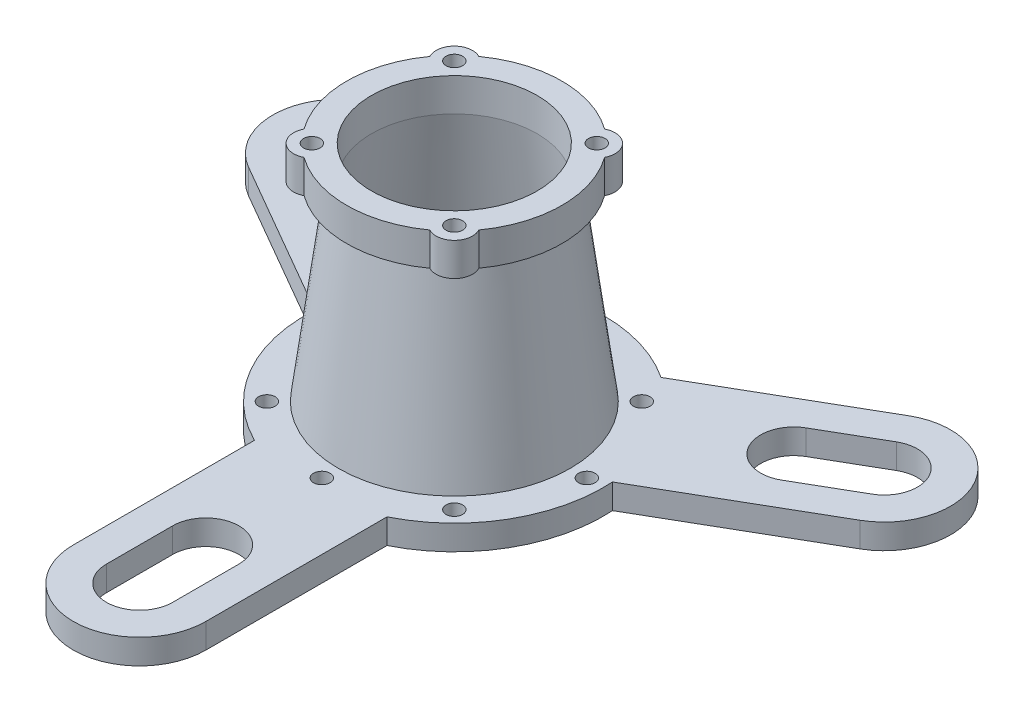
ISO-10303-21;
HEADER;
FILE_DESCRIPTION(('STEP AP214'),'2;1');
FILE_NAME('part.step','',(''),(''),'','','');
FILE_SCHEMA(('AUTOMOTIVE_DESIGN { 1 0 10303 214 1 1 1 1 }'));
ENDSEC;
DATA;
#1=APPLICATION_CONTEXT('core data for automotive mechanical design processes');
#2=APPLICATION_PROTOCOL_DEFINITION('international standard','automotive_design',2000,#1);
#3=PRODUCT_CONTEXT('',#1,'mechanical');
#4=PRODUCT('Part','Part','',(#3));
#5=PRODUCT_RELATED_PRODUCT_CATEGORY('part','',(#4));
#6=PRODUCT_DEFINITION_FORMATION('','',#4);
#7=PRODUCT_DEFINITION_CONTEXT('part definition',#1,'design');
#8=PRODUCT_DEFINITION('design','',#6,#7);
#9=PRODUCT_DEFINITION_SHAPE('','',#8);
#10=(LENGTH_UNIT() NAMED_UNIT(*) SI_UNIT(.MILLI.,.METRE.));
#11=(NAMED_UNIT(*) PLANE_ANGLE_UNIT() SI_UNIT($,.RADIAN.));
#12=(NAMED_UNIT(*) SI_UNIT($,.STERADIAN.) SOLID_ANGLE_UNIT());
#13=UNCERTAINTY_MEASURE_WITH_UNIT(LENGTH_MEASURE(1.E-05),#10,'distance_accuracy_value','');
#14=(GEOMETRIC_REPRESENTATION_CONTEXT(3) GLOBAL_UNCERTAINTY_ASSIGNED_CONTEXT((#13)) GLOBAL_UNIT_ASSIGNED_CONTEXT((#10,
#11,#12)) REPRESENTATION_CONTEXT('',''));
#15=CARTESIAN_POINT('',(0.,0.,0.));
#16=DIRECTION('',(0.,0.,1.));
#17=DIRECTION('',(1.,0.,0.));
#18=AXIS2_PLACEMENT_3D('',#15,#16,#17);
#19=CARTESIAN_POINT('',(0.,-15.,0.));
#20=DIRECTION('',(0.,1.,0.));
#21=DIRECTION('',(0.,0.,1.));
#22=AXIS2_PLACEMENT_3D('',#19,#20,#21);
#23=CYLINDRICAL_SURFACE('',#22,90.);
#24=CARTESIAN_POINT('',(0.,-15.,0.));
#25=DIRECTION('',(0.,-1.,0.));
#26=DIRECTION('',(0.,0.,-1.));
#27=AXIS2_PLACEMENT_3D('',#24,#25,#26);
#28=CIRCLE('',#27,90.);
#29=CARTESIAN_POINT('',(89.8212002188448,-15.,-5.67027259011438));
#30=VERTEX_POINT('',#29);
#31=CARTESIAN_POINT('',(40.,-15.,80.6225774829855));
#32=VERTEX_POINT('',#31);
#33=EDGE_CURVE('E122',#30,#32,#28,.T.);
#34=ORIENTED_EDGE('',*,*,#33,.F.);
#35=DIRECTION('',(0.,1.,0.));
#36=VECTOR('',#35,1.);
#37=CARTESIAN_POINT('',(89.8212002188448,-15.,-5.67027259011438));
#38=LINE('',#37,#36);
#39=CARTESIAN_POINT('',(89.8212002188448,0.,-5.67027259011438));
#40=VERTEX_POINT('',#39);
#41=EDGE_CURVE('E528',#30,#40,#38,.T.);
#42=ORIENTED_EDGE('',*,*,#41,.T.);
#43=CARTESIAN_POINT('',(0.,0.,0.));
#44=DIRECTION('',(0.,-1.,0.));
#45=DIRECTION('',(0.,0.,-1.));
#46=AXIS2_PLACEMENT_3D('',#43,#44,#45);
#47=CIRCLE('',#46,90.);
#48=CARTESIAN_POINT('',(40.,0.,80.6225774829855));
#49=VERTEX_POINT('',#48);
#50=EDGE_CURVE('E688',#40,#49,#47,.T.);
#51=ORIENTED_EDGE('',*,*,#50,.T.);
#52=DIRECTION('',(0.,1.,0.));
#53=VECTOR('',#52,1.);
#54=CARTESIAN_POINT('',(40.,-15.,80.6225774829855));
#55=LINE('',#54,#53);
#56=EDGE_CURVE('E693',#32,#49,#55,.T.);
#57=ORIENTED_EDGE('',*,*,#56,.F.);
#58=EDGE_LOOP('',(#34,#42,#51,#57));
#59=FACE_BOUND('',#58,.T.);
#60=ADVANCED_FACE('F111',(#59),#23,.T.);
#61=CARTESIAN_POINT('',(-49.8212002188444,0.,-74.9523048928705));
#62=VERTEX_POINT('',#61);
#63=CARTESIAN_POINT('',(49.8212002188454,0.,-74.9523048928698));
#64=VERTEX_POINT('',#63);
#65=EDGE_CURVE('E722',#62,#64,#47,.T.);
#66=ORIENTED_EDGE('',*,*,#65,.T.);
#67=DIRECTION('',(0.,1.,0.));
#68=VECTOR('',#67,1.);
#69=CARTESIAN_POINT('',(49.8212002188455,-15.,-74.9523048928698));
#70=LINE('',#69,#68);
#71=CARTESIAN_POINT('',(49.8212002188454,-15.,-74.9523048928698));
#72=VERTEX_POINT('',#71);
#73=EDGE_CURVE('E136',#72,#64,#70,.T.);
#74=ORIENTED_EDGE('',*,*,#73,.F.);
#75=CARTESIAN_POINT('',(-49.8212002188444,-15.,-74.9523048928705));
#76=VERTEX_POINT('',#75);
#77=EDGE_CURVE('E121',#76,#72,#28,.T.);
#78=ORIENTED_EDGE('',*,*,#77,.F.);
#79=DIRECTION('',(0.,1.,0.));
#80=VECTOR('',#79,1.);
#81=CARTESIAN_POINT('',(-49.8212002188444,-15.,-74.9523048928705));
#82=LINE('',#81,#80);
#83=EDGE_CURVE('E607',#76,#62,#82,.T.);
#84=ORIENTED_EDGE('',*,*,#83,.T.);
#85=EDGE_LOOP('',(#66,#74,#78,#84));
#86=FACE_BOUND('',#85,.T.);
#87=ADVANCED_FACE('F739',(#86),#23,.T.);
#88=CARTESIAN_POINT('',(0.,-15.,0.));
#89=DIRECTION('',(0.,-1.,0.));
#90=DIRECTION('',(0.,0.,-1.));
#91=AXIS2_PLACEMENT_3D('',#88,#89,#90);
#92=PLANE('',#91);
#93=CARTESIAN_POINT('',(-80.,-15.,0.));
#94=DIRECTION('',(0.,1.,0.));
#95=DIRECTION('',(0.,0.,-1.));
#96=AXIS2_PLACEMENT_3D('',#93,#94,#95);
#97=CIRCLE('',#96,5.);
#98=CARTESIAN_POINT('',(-80.,-15.,-5.));
#99=VERTEX_POINT('',#98);
#100=EDGE_CURVE('E416',#99,#99,#97,.T.);
#101=ORIENTED_EDGE('',*,*,#100,.T.);
#102=EDGE_LOOP('',(#101));
#103=FACE_BOUND('',#102,.T.);
#104=CARTESIAN_POINT('',(-56.5685424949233,-15.,56.5685424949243));
#105=DIRECTION('',(0.,1.,0.));
#106=DIRECTION('',(-0.707106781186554,0.,-0.707106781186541));
#107=AXIS2_PLACEMENT_3D('',#104,#105,#106);
#108=CIRCLE('',#107,5.);
#109=CARTESIAN_POINT('',(-60.1040764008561,-15.,53.0330085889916));
#110=VERTEX_POINT('',#109);
#111=EDGE_CURVE('E408',#110,#110,#108,.T.);
#112=ORIENTED_EDGE('',*,*,#111,.T.);
#113=EDGE_LOOP('',(#112));
#114=FACE_BOUND('',#113,.T.);
#115=CARTESIAN_POINT('',(-2.79318507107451E-13,-15.,-80.));
#116=DIRECTION('',(0.,1.,0.));
#117=DIRECTION('',(1.,0.,0.));
#118=AXIS2_PLACEMENT_3D('',#115,#116,#117);
#119=CIRCLE('',#118,5.);
#120=CARTESIAN_POINT('',(4.99999999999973,-15.,-80.));
#121=VERTEX_POINT('',#120);
#122=EDGE_CURVE('E432',#121,#121,#119,.T.);
#123=ORIENTED_EDGE('',*,*,#122,.T.);
#124=EDGE_LOOP('',(#123));
#125=FACE_BOUND('',#124,.T.);
#126=CARTESIAN_POINT('',(-56.5685424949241,-15.,-56.5685424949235));
#127=DIRECTION('',(0.,1.,0.));
#128=DIRECTION('',(0.707106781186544,0.,-0.707106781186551));
#129=AXIS2_PLACEMENT_3D('',#126,#127,#128);
#130=CIRCLE('',#129,5.);
#131=CARTESIAN_POINT('',(-53.0330085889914,-15.,-60.1040764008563));
#132=VERTEX_POINT('',#131);
#133=EDGE_CURVE('E424',#132,#132,#130,.T.);
#134=ORIENTED_EDGE('',*,*,#133,.T.);
#135=EDGE_LOOP('',(#134));
#136=FACE_BOUND('',#135,.T.);
#137=CARTESIAN_POINT('',(8.37955521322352E-13,-15.,80.));
#138=DIRECTION('',(0.,1.,0.));
#139=DIRECTION('',(-1.,0.,0.));
#140=AXIS2_PLACEMENT_3D('',#137,#138,#139);
#141=CIRCLE('',#140,5.);
#142=CARTESIAN_POINT('',(-4.99999999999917,-15.,80.0000000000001));
#143=VERTEX_POINT('',#142);
#144=EDGE_CURVE('E400',#143,#143,#141,.T.);
#145=ORIENTED_EDGE('',*,*,#144,.T.);
#146=EDGE_LOOP('',(#145));
#147=FACE_BOUND('',#146,.T.);
#148=CARTESIAN_POINT('',(56.5685424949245,-15.,56.5685424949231));
#149=DIRECTION('',(0.,1.,0.));
#150=DIRECTION('',(-0.707106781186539,0.,0.707106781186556));
#151=AXIS2_PLACEMENT_3D('',#148,#149,#150);
#152=CIRCLE('',#151,5.);
#153=CARTESIAN_POINT('',(53.0330085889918,-15.,60.1040764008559));
#154=VERTEX_POINT('',#153);
#155=EDGE_CURVE('E392',#154,#154,#152,.T.);
#156=ORIENTED_EDGE('',*,*,#155,.T.);
#157=EDGE_LOOP('',(#156));
#158=FACE_BOUND('',#157,.T.);
#159=CARTESIAN_POINT('',(56.5685424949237,-15.,-56.5685424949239));
#160=DIRECTION('',(0.,1.,0.));
#161=DIRECTION('',(0.707106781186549,0.,0.707106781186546));
#162=AXIS2_PLACEMENT_3D('',#159,#160,#161);
#163=CIRCLE('',#162,5.);
#164=CARTESIAN_POINT('',(60.1040764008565,-15.,-53.0330085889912));
#165=VERTEX_POINT('',#164);
#166=EDGE_CURVE('E440',#165,#165,#163,.T.);
#167=ORIENTED_EDGE('',*,*,#166,.T.);
#168=EDGE_LOOP('',(#167));
#169=FACE_BOUND('',#168,.T.);
#170=CARTESIAN_POINT('',(80.,-15.,0.));
#171=DIRECTION('',(0.,1.,0.));
#172=DIRECTION('',(0.,0.,1.));
#173=AXIS2_PLACEMENT_3D('',#170,#171,#172);
#174=CIRCLE('',#173,5.);
#175=CARTESIAN_POINT('',(80.,-15.,5.));
#176=VERTEX_POINT('',#175);
#177=EDGE_CURVE('E448',#176,#176,#174,.T.);
#178=ORIENTED_EDGE('',*,*,#177,.T.);
#179=EDGE_LOOP('',(#178));
#180=FACE_BOUND('',#179,.T.);
#181=CARTESIAN_POINT('',(-40.,-15.,80.6225774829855));
#182=VERTEX_POINT('',#181);
#183=CARTESIAN_POINT('',(-89.8212002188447,-15.,-5.67027259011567));
#184=VERTEX_POINT('',#183);
#185=EDGE_CURVE('E12',#182,#184,#28,.T.);
#186=ORIENTED_EDGE('',*,*,#185,.T.);
#187=DIRECTION('',(0.866025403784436,0.,0.500000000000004));
#188=VECTOR('',#187,1.);
#189=CARTESIAN_POINT('',(-184.544826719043,-15.,-60.3589838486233));
#190=LINE('',#189,#188);
#191=CARTESIAN_POINT('',(-184.544826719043,-15.,-60.3589838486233));
#192=VERTEX_POINT('',#191);
#193=EDGE_CURVE('E583',#192,#184,#190,.T.);
#194=ORIENTED_EDGE('',*,*,#193,.F.);
#195=CARTESIAN_POINT('',(-164.544826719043,-15.,-95.0000000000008));
#196=DIRECTION('',(0.,1.,0.));
#197=DIRECTION('',(-0.866025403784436,0.,-0.500000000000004));
#198=AXIS2_PLACEMENT_3D('',#195,#196,#197);
#199=CIRCLE('',#198,40.);
#200=CARTESIAN_POINT('',(-144.544826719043,-15.,-129.641016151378));
#201=VERTEX_POINT('',#200);
#202=EDGE_CURVE('E579',#201,#192,#199,.T.);
#203=ORIENTED_EDGE('',*,*,#202,.F.);
#204=DIRECTION('',(-0.866025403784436,0.,-0.500000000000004));
#205=VECTOR('',#204,1.);
#206=CARTESIAN_POINT('',(-144.544826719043,-15.,-129.641016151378));
#207=LINE('',#206,#205);
#208=EDGE_CURVE('E588',#76,#201,#207,.T.);
#209=ORIENTED_EDGE('',*,*,#208,.F.);
#210=ORIENTED_EDGE('',*,*,#77,.T.);
#211=DIRECTION('',(-0.866025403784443,0.,0.499999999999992));
#212=VECTOR('',#211,1.);
#213=CARTESIAN_POINT('',(144.544826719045,-15.,-129.641016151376));
#214=LINE('',#213,#212);
#215=CARTESIAN_POINT('',(144.544826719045,-15.,-129.641016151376));
#216=VERTEX_POINT('',#215);
#217=EDGE_CURVE('E504',#216,#72,#214,.T.);
#218=ORIENTED_EDGE('',*,*,#217,.F.);
#219=CARTESIAN_POINT('',(164.544826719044,-15.,-94.9999999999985));
#220=DIRECTION('',(0.,1.,0.));
#221=DIRECTION('',(0.866025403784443,0.,-0.499999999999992));
#222=AXIS2_PLACEMENT_3D('',#219,#220,#221);
#223=CIRCLE('',#222,40.);
#224=CARTESIAN_POINT('',(184.544826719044,-15.,-60.3589838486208));
#225=VERTEX_POINT('',#224);
#226=EDGE_CURVE('E500',#225,#216,#223,.T.);
#227=ORIENTED_EDGE('',*,*,#226,.F.);
#228=DIRECTION('',(0.866025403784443,0.,-0.499999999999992));
#229=VECTOR('',#228,1.);
#230=CARTESIAN_POINT('',(184.544826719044,-15.,-60.3589838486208));
#231=LINE('',#230,#229);
#232=EDGE_CURVE('E509',#30,#225,#231,.T.);
#233=ORIENTED_EDGE('',*,*,#232,.F.);
#234=ORIENTED_EDGE('',*,*,#33,.T.);
#235=DIRECTION('',(0.,0.,-1.));
#236=VECTOR('',#235,1.);
#237=CARTESIAN_POINT('',(40.,-15.,190.));
#238=LINE('',#237,#236);
#239=CARTESIAN_POINT('',(40.,-15.,190.));
#240=VERTEX_POINT('',#239);
#241=EDGE_CURVE('E665',#240,#32,#238,.T.);
#242=ORIENTED_EDGE('',*,*,#241,.F.);
#243=CARTESIAN_POINT('',(0.,-15.,190.));
#244=DIRECTION('',(0.,1.,0.));
#245=DIRECTION('',(0.,0.,1.));
#246=AXIS2_PLACEMENT_3D('',#243,#244,#245);
#247=CIRCLE('',#246,40.);
#248=CARTESIAN_POINT('',(-40.,-15.,190.));
#249=VERTEX_POINT('',#248);
#250=EDGE_CURVE('E661',#249,#240,#247,.T.);
#251=ORIENTED_EDGE('',*,*,#250,.F.);
#252=DIRECTION('',(0.,0.,1.));
#253=VECTOR('',#252,1.);
#254=CARTESIAN_POINT('',(-40.,-15.,190.));
#255=LINE('',#254,#253);
#256=EDGE_CURVE('E670',#182,#249,#255,.T.);
#257=ORIENTED_EDGE('',*,*,#256,.F.);
#258=EDGE_LOOP('',(#186,#194,#203,#209,#210,#218,#227,#233,#234,#242,#251,#257));
#259=FACE_BOUND('',#258,.T.);
#260=DIRECTION('',(0.,0.,1.));
#261=VECTOR('',#260,1.);
#262=CARTESIAN_POINT('',(-20.,-15.,190.));
#263=LINE('',#262,#261);
#264=CARTESIAN_POINT('',(-20.,-15.,150.));
#265=VERTEX_POINT('',#264);
#266=CARTESIAN_POINT('',(-20.,-15.,190.));
#267=VERTEX_POINT('',#266);
#268=EDGE_CURVE('E630',#265,#267,#263,.T.);
#269=ORIENTED_EDGE('',*,*,#268,.T.);
#270=CARTESIAN_POINT('',(0.,-15.,190.));
#271=DIRECTION('',(0.,1.,0.));
#272=DIRECTION('',(0.,0.,1.));
#273=AXIS2_PLACEMENT_3D('',#270,#271,#272);
#274=CIRCLE('',#273,20.);
#275=CARTESIAN_POINT('',(20.,-15.,190.));
#276=VERTEX_POINT('',#275);
#277=EDGE_CURVE('E617',#267,#276,#274,.T.);
#278=ORIENTED_EDGE('',*,*,#277,.T.);
#279=DIRECTION('',(0.,0.,-1.));
#280=VECTOR('',#279,1.);
#281=CARTESIAN_POINT('',(20.,-15.,190.));
#282=LINE('',#281,#280);
#283=CARTESIAN_POINT('',(20.,-15.,150.));
#284=VERTEX_POINT('',#283);
#285=EDGE_CURVE('E621',#276,#284,#282,.T.);
#286=ORIENTED_EDGE('',*,*,#285,.T.);
#287=CARTESIAN_POINT('',(0.,-15.,150.));
#288=DIRECTION('',(0.,1.,0.));
#289=DIRECTION('',(0.,0.,1.));
#290=AXIS2_PLACEMENT_3D('',#287,#288,#289);
#291=CIRCLE('',#290,20.);
#292=EDGE_CURVE('E626',#284,#265,#291,.T.);
#293=ORIENTED_EDGE('',*,*,#292,.T.);
#294=EDGE_LOOP('',(#269,#278,#286,#293));
#295=FACE_BOUND('',#294,.T.);
#296=DIRECTION('',(-0.866025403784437,0.,-0.500000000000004));
#297=VECTOR('',#296,1.);
#298=CARTESIAN_POINT('',(-154.544826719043,-15.,-112.32050807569));
#299=LINE('',#298,#297);
#300=CARTESIAN_POINT('',(-119.903810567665,-15.,-92.3205080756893));
#301=VERTEX_POINT('',#300);
#302=CARTESIAN_POINT('',(-154.544826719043,-15.,-112.32050807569));
#303=VERTEX_POINT('',#302);
#304=EDGE_CURVE('E548',#301,#303,#299,.T.);
#305=ORIENTED_EDGE('',*,*,#304,.T.);
#306=CARTESIAN_POINT('',(-164.544826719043,-15.,-95.0000000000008));
#307=DIRECTION('',(0.,1.,0.));
#308=DIRECTION('',(-0.866025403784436,0.,-0.500000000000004));
#309=AXIS2_PLACEMENT_3D('',#306,#307,#308);
#310=CIRCLE('',#309,20.);
#311=CARTESIAN_POINT('',(-174.544826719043,-15.,-77.679491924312));
#312=VERTEX_POINT('',#311);
#313=EDGE_CURVE('E535',#303,#312,#310,.T.);
#314=ORIENTED_EDGE('',*,*,#313,.T.);
#315=DIRECTION('',(0.866025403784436,0.,0.500000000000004));
#316=VECTOR('',#315,1.);
#317=CARTESIAN_POINT('',(-174.544826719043,-15.,-77.679491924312));
#318=LINE('',#317,#316);
#319=CARTESIAN_POINT('',(-139.903810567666,-15.,-57.6794919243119));
#320=VERTEX_POINT('',#319);
#321=EDGE_CURVE('E539',#312,#320,#318,.T.);
#322=ORIENTED_EDGE('',*,*,#321,.T.);
#323=CARTESIAN_POINT('',(-129.903810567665,-15.,-75.0000000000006));
#324=DIRECTION('',(0.,1.,0.));
#325=DIRECTION('',(-0.866025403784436,0.,-0.500000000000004));
#326=AXIS2_PLACEMENT_3D('',#323,#324,#325);
#327=CIRCLE('',#326,20.);
#328=EDGE_CURVE('E544',#320,#301,#327,.T.);
#329=ORIENTED_EDGE('',*,*,#328,.T.);
#330=EDGE_LOOP('',(#305,#314,#322,#329));
#331=FACE_BOUND('',#330,.T.);
#332=DIRECTION('',(0.866025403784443,0.,-0.499999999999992));
#333=VECTOR('',#332,1.);
#334=CARTESIAN_POINT('',(174.544826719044,-15.,-77.6794919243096));
#335=LINE('',#334,#333);
#336=CARTESIAN_POINT('',(139.903810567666,-15.,-57.6794919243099));
#337=VERTEX_POINT('',#336);
#338=CARTESIAN_POINT('',(174.544826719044,-15.,-77.6794919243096));
#339=VERTEX_POINT('',#338);
#340=EDGE_CURVE('E469',#337,#339,#335,.T.);
#341=ORIENTED_EDGE('',*,*,#340,.T.);
#342=CARTESIAN_POINT('',(164.544826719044,-15.,-94.9999999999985));
#343=DIRECTION('',(0.,1.,0.));
#344=DIRECTION('',(0.866025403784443,0.,-0.499999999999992));
#345=AXIS2_PLACEMENT_3D('',#342,#343,#344);
#346=CIRCLE('',#345,20.);
#347=CARTESIAN_POINT('',(154.544826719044,-15.,-112.320508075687));
#348=VERTEX_POINT('',#347);
#349=EDGE_CURVE('E456',#339,#348,#346,.T.);
#350=ORIENTED_EDGE('',*,*,#349,.T.);
#351=DIRECTION('',(-0.866025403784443,0.,0.499999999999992));
#352=VECTOR('',#351,1.);
#353=CARTESIAN_POINT('',(154.544826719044,-15.,-112.320508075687));
#354=LINE('',#353,#352);
#355=CARTESIAN_POINT('',(119.903810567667,-15.,-92.3205080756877));
#356=VERTEX_POINT('',#355);
#357=EDGE_CURVE('E460',#348,#356,#354,.T.);
#358=ORIENTED_EDGE('',*,*,#357,.T.);
#359=CARTESIAN_POINT('',(129.903810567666,-15.,-74.9999999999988));
#360=DIRECTION('',(0.,1.,0.));
#361=DIRECTION('',(0.866025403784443,0.,-0.499999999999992));
#362=AXIS2_PLACEMENT_3D('',#359,#360,#361);
#363=CIRCLE('',#362,20.);
#364=EDGE_CURVE('E465',#356,#337,#363,.T.);
#365=ORIENTED_EDGE('',*,*,#364,.T.);
#366=EDGE_LOOP('',(#341,#350,#358,#365));
#367=FACE_BOUND('',#366,.T.);
#368=CARTESIAN_POINT('',(0.,-15.,0.));
#369=DIRECTION('',(0.,-1.,0.));
#370=DIRECTION('',(0.,0.,-1.));
#371=AXIS2_PLACEMENT_3D('',#368,#369,#370);
#372=CIRCLE('',#371,65.);
#373=CARTESIAN_POINT('',(0.,-15.,65.));
#374=VERTEX_POINT('',#373);
#375=EDGE_CURVE('E383',#374,#374,#372,.T.);
#376=ORIENTED_EDGE('',*,*,#375,.F.);
#377=EDGE_LOOP('',(#376));
#378=FACE_BOUND('',#377,.T.);
#379=ADVANCED_FACE('F715',(#103,#114,#125,#136,#147,#158,#169,#180,#259,#295,#331,#367,#378),
#92,.T.);
#380=CARTESIAN_POINT('',(0.,0.,0.));
#381=DIRECTION('',(0.,-1.,0.));
#382=DIRECTION('',(0.,0.,-1.));
#383=AXIS2_PLACEMENT_3D('',#380,#381,#382);
#384=PLANE('',#383);
#385=CARTESIAN_POINT('',(0.,0.,0.));
#386=DIRECTION('',(0.,-1.,0.));
#387=DIRECTION('',(0.,0.,-1.));
#388=AXIS2_PLACEMENT_3D('',#385,#386,#387);
#389=CIRCLE('',#388,70.);
#390=CARTESIAN_POINT('',(0.,0.,-70.));
#391=VERTEX_POINT('',#390);
#392=EDGE_CURVE('E375',#391,#391,#389,.T.);
#393=ORIENTED_EDGE('',*,*,#392,.T.);
#394=EDGE_LOOP('',(#393));
#395=FACE_BOUND('',#394,.T.);
#396=CARTESIAN_POINT('',(-80.,0.,0.));
#397=DIRECTION('',(0.,1.,0.));
#398=DIRECTION('',(0.,0.,-1.));
#399=AXIS2_PLACEMENT_3D('',#396,#397,#398);
#400=CIRCLE('',#399,5.);
#401=CARTESIAN_POINT('',(-80.,0.,-5.));
#402=VERTEX_POINT('',#401);
#403=EDGE_CURVE('E412',#402,#402,#400,.T.);
#404=ORIENTED_EDGE('',*,*,#403,.F.);
#405=EDGE_LOOP('',(#404));
#406=FACE_BOUND('',#405,.T.);
#407=CARTESIAN_POINT('',(-56.5685424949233,0.,56.5685424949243));
#408=DIRECTION('',(0.,1.,0.));
#409=DIRECTION('',(-0.707106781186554,0.,-0.707106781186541));
#410=AXIS2_PLACEMENT_3D('',#407,#408,#409);
#411=CIRCLE('',#410,5.);
#412=CARTESIAN_POINT('',(-60.1040764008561,0.,53.0330085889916));
#413=VERTEX_POINT('',#412);
#414=EDGE_CURVE('E404',#413,#413,#411,.T.);
#415=ORIENTED_EDGE('',*,*,#414,.F.);
#416=EDGE_LOOP('',(#415));
#417=FACE_BOUND('',#416,.T.);
#418=CARTESIAN_POINT('',(-2.79318507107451E-13,0.,-80.));
#419=DIRECTION('',(0.,1.,0.));
#420=DIRECTION('',(1.,0.,0.));
#421=AXIS2_PLACEMENT_3D('',#418,#419,#420);
#422=CIRCLE('',#421,5.);
#423=CARTESIAN_POINT('',(4.99999999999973,0.,-80.));
#424=VERTEX_POINT('',#423);
#425=EDGE_CURVE('E428',#424,#424,#422,.T.);
#426=ORIENTED_EDGE('',*,*,#425,.F.);
#427=EDGE_LOOP('',(#426));
#428=FACE_BOUND('',#427,.T.);
#429=CARTESIAN_POINT('',(-56.5685424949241,0.,-56.5685424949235));
#430=DIRECTION('',(0.,1.,0.));
#431=DIRECTION('',(0.707106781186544,0.,-0.707106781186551));
#432=AXIS2_PLACEMENT_3D('',#429,#430,#431);
#433=CIRCLE('',#432,5.);
#434=CARTESIAN_POINT('',(-53.0330085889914,0.,-60.1040764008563));
#435=VERTEX_POINT('',#434);
#436=EDGE_CURVE('E420',#435,#435,#433,.T.);
#437=ORIENTED_EDGE('',*,*,#436,.F.);
#438=EDGE_LOOP('',(#437));
#439=FACE_BOUND('',#438,.T.);
#440=CARTESIAN_POINT('',(8.37955521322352E-13,0.,80.));
#441=DIRECTION('',(0.,1.,0.));
#442=DIRECTION('',(-1.,0.,0.));
#443=AXIS2_PLACEMENT_3D('',#440,#441,#442);
#444=CIRCLE('',#443,5.);
#445=CARTESIAN_POINT('',(-4.99999999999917,0.,80.0000000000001));
#446=VERTEX_POINT('',#445);
#447=EDGE_CURVE('E396',#446,#446,#444,.T.);
#448=ORIENTED_EDGE('',*,*,#447,.F.);
#449=EDGE_LOOP('',(#448));
#450=FACE_BOUND('',#449,.T.);
#451=CARTESIAN_POINT('',(56.5685424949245,0.,56.5685424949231));
#452=DIRECTION('',(0.,1.,0.));
#453=DIRECTION('',(-0.707106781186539,0.,0.707106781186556));
#454=AXIS2_PLACEMENT_3D('',#451,#452,#453);
#455=CIRCLE('',#454,5.);
#456=CARTESIAN_POINT('',(53.0330085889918,0.,60.1040764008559));
#457=VERTEX_POINT('',#456);
#458=EDGE_CURVE('E388',#457,#457,#455,.T.);
#459=ORIENTED_EDGE('',*,*,#458,.F.);
#460=EDGE_LOOP('',(#459));
#461=FACE_BOUND('',#460,.T.);
#462=CARTESIAN_POINT('',(56.5685424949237,0.,-56.5685424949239));
#463=DIRECTION('',(0.,1.,0.));
#464=DIRECTION('',(0.707106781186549,0.,0.707106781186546));
#465=AXIS2_PLACEMENT_3D('',#462,#463,#464);
#466=CIRCLE('',#465,5.);
#467=CARTESIAN_POINT('',(60.1040764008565,0.,-53.0330085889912));
#468=VERTEX_POINT('',#467);
#469=EDGE_CURVE('E436',#468,#468,#466,.T.);
#470=ORIENTED_EDGE('',*,*,#469,.F.);
#471=EDGE_LOOP('',(#470));
#472=FACE_BOUND('',#471,.T.);
#473=CARTESIAN_POINT('',(80.,0.,0.));
#474=DIRECTION('',(0.,1.,0.));
#475=DIRECTION('',(0.,0.,1.));
#476=AXIS2_PLACEMENT_3D('',#473,#474,#475);
#477=CIRCLE('',#476,5.);
#478=CARTESIAN_POINT('',(80.,0.,5.));
#479=VERTEX_POINT('',#478);
#480=EDGE_CURVE('E444',#479,#479,#477,.T.);
#481=ORIENTED_EDGE('',*,*,#480,.F.);
#482=EDGE_LOOP('',(#481));
#483=FACE_BOUND('',#482,.T.);
#484=CARTESIAN_POINT('',(-40.,0.,80.6225774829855));
#485=VERTEX_POINT('',#484);
#486=CARTESIAN_POINT('',(-89.8212002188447,0.,-5.67027259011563));
#487=VERTEX_POINT('',#486);
#488=EDGE_CURVE('E115',#485,#487,#47,.T.);
#489=ORIENTED_EDGE('',*,*,#488,.F.);
#490=DIRECTION('',(0.,0.,1.));
#491=VECTOR('',#490,1.);
#492=CARTESIAN_POINT('',(-40.,0.,190.));
#493=LINE('',#492,#491);
#494=CARTESIAN_POINT('',(-40.,0.,190.));
#495=VERTEX_POINT('',#494);
#496=EDGE_CURVE('E666',#485,#495,#493,.T.);
#497=ORIENTED_EDGE('',*,*,#496,.T.);
#498=CARTESIAN_POINT('',(0.,0.,190.));
#499=DIRECTION('',(0.,1.,0.));
#500=DIRECTION('',(0.,0.,1.));
#501=AXIS2_PLACEMENT_3D('',#498,#499,#500);
#502=CIRCLE('',#501,40.);
#503=CARTESIAN_POINT('',(40.,0.,190.));
#504=VERTEX_POINT('',#503);
#505=EDGE_CURVE('E651',#495,#504,#502,.T.);
#506=ORIENTED_EDGE('',*,*,#505,.T.);
#507=DIRECTION('',(0.,0.,-1.));
#508=VECTOR('',#507,1.);
#509=CARTESIAN_POINT('',(40.,0.,190.));
#510=LINE('',#509,#508);
#511=EDGE_CURVE('E678',#504,#49,#510,.T.);
#512=ORIENTED_EDGE('',*,*,#511,.T.);
#513=ORIENTED_EDGE('',*,*,#50,.F.);
#514=DIRECTION('',(0.866025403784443,0.,-0.499999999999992));
#515=VECTOR('',#514,1.);
#516=CARTESIAN_POINT('',(184.544826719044,0.,-60.3589838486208));
#517=LINE('',#516,#515);
#518=CARTESIAN_POINT('',(184.544826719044,0.,-60.3589838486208));
#519=VERTEX_POINT('',#518);
#520=EDGE_CURVE('E505',#40,#519,#517,.T.);
#521=ORIENTED_EDGE('',*,*,#520,.T.);
#522=CARTESIAN_POINT('',(164.544826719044,0.,-94.9999999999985));
#523=DIRECTION('',(0.,1.,0.));
#524=DIRECTION('',(0.866025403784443,0.,-0.499999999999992));
#525=AXIS2_PLACEMENT_3D('',#522,#523,#524);
#526=CIRCLE('',#525,40.);
#527=CARTESIAN_POINT('',(144.544826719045,0.,-129.641016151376));
#528=VERTEX_POINT('',#527);
#529=EDGE_CURVE('E490',#519,#528,#526,.T.);
#530=ORIENTED_EDGE('',*,*,#529,.T.);
#531=DIRECTION('',(-0.866025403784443,0.,0.499999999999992));
#532=VECTOR('',#531,1.);
#533=CARTESIAN_POINT('',(144.544826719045,0.,-129.641016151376));
#534=LINE('',#533,#532);
#535=EDGE_CURVE('E517',#528,#64,#534,.T.);
#536=ORIENTED_EDGE('',*,*,#535,.T.);
#537=ORIENTED_EDGE('',*,*,#65,.F.);
#538=DIRECTION('',(-0.866025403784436,0.,-0.500000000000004));
#539=VECTOR('',#538,1.);
#540=CARTESIAN_POINT('',(-144.544826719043,0.,-129.641016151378));
#541=LINE('',#540,#539);
#542=CARTESIAN_POINT('',(-144.544826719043,0.,-129.641016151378));
#543=VERTEX_POINT('',#542);
#544=EDGE_CURVE('E584',#62,#543,#541,.T.);
#545=ORIENTED_EDGE('',*,*,#544,.T.);
#546=CARTESIAN_POINT('',(-164.544826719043,0.,-95.0000000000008));
#547=DIRECTION('',(0.,1.,0.));
#548=DIRECTION('',(-0.866025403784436,0.,-0.500000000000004));
#549=AXIS2_PLACEMENT_3D('',#546,#547,#548);
#550=CIRCLE('',#549,40.);
#551=CARTESIAN_POINT('',(-184.544826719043,0.,-60.3589838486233));
#552=VERTEX_POINT('',#551);
#553=EDGE_CURVE('E569',#543,#552,#550,.T.);
#554=ORIENTED_EDGE('',*,*,#553,.T.);
#555=DIRECTION('',(0.866025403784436,0.,0.500000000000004));
#556=VECTOR('',#555,1.);
#557=CARTESIAN_POINT('',(-184.544826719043,0.,-60.3589838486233));
#558=LINE('',#557,#556);
#559=EDGE_CURVE('E596',#552,#487,#558,.T.);
#560=ORIENTED_EDGE('',*,*,#559,.T.);
#561=EDGE_LOOP('',(#489,#497,#506,#512,#513,#521,#530,#536,#537,#545,#554,#560));
#562=FACE_BOUND('',#561,.T.);
#563=CARTESIAN_POINT('',(0.,0.,190.));
#564=DIRECTION('',(0.,1.,0.));
#565=DIRECTION('',(0.,0.,1.));
#566=AXIS2_PLACEMENT_3D('',#563,#564,#565);
#567=CIRCLE('',#566,20.);
#568=CARTESIAN_POINT('',(-20.,0.,190.));
#569=VERTEX_POINT('',#568);
#570=CARTESIAN_POINT('',(20.,0.,190.));
#571=VERTEX_POINT('',#570);
#572=EDGE_CURVE('E606',#569,#571,#567,.T.);
#573=ORIENTED_EDGE('',*,*,#572,.F.);
#574=DIRECTION('',(0.,0.,1.));
#575=VECTOR('',#574,1.);
#576=CARTESIAN_POINT('',(-20.,0.,190.));
#577=LINE('',#576,#575);
#578=CARTESIAN_POINT('',(-20.,0.,150.));
#579=VERTEX_POINT('',#578);
#580=EDGE_CURVE('E622',#579,#569,#577,.T.);
#581=ORIENTED_EDGE('',*,*,#580,.F.);
#582=CARTESIAN_POINT('',(0.,0.,150.));
#583=DIRECTION('',(0.,1.,0.));
#584=DIRECTION('',(0.,0.,1.));
#585=AXIS2_PLACEMENT_3D('',#582,#583,#584);
#586=CIRCLE('',#585,20.);
#587=CARTESIAN_POINT('',(20.,0.,150.));
#588=VERTEX_POINT('',#587);
#589=EDGE_CURVE('E641',#588,#579,#586,.T.);
#590=ORIENTED_EDGE('',*,*,#589,.F.);
#591=DIRECTION('',(0.,0.,-1.));
#592=VECTOR('',#591,1.);
#593=CARTESIAN_POINT('',(20.,0.,190.));
#594=LINE('',#593,#592);
#595=EDGE_CURVE('E637',#571,#588,#594,.T.);
#596=ORIENTED_EDGE('',*,*,#595,.F.);
#597=EDGE_LOOP('',(#573,#581,#590,#596));
#598=FACE_BOUND('',#597,.T.);
#599=CARTESIAN_POINT('',(-164.544826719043,0.,-95.0000000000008));
#600=DIRECTION('',(0.,1.,0.));
#601=DIRECTION('',(-0.866025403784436,0.,-0.500000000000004));
#602=AXIS2_PLACEMENT_3D('',#599,#600,#601);
#603=CIRCLE('',#602,20.);
#604=CARTESIAN_POINT('',(-154.544826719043,0.,-112.32050807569));
#605=VERTEX_POINT('',#604);
#606=CARTESIAN_POINT('',(-174.544826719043,0.,-77.679491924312));
#607=VERTEX_POINT('',#606);
#608=EDGE_CURVE('E527',#605,#607,#603,.T.);
#609=ORIENTED_EDGE('',*,*,#608,.F.);
#610=DIRECTION('',(-0.866025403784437,0.,-0.500000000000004));
#611=VECTOR('',#610,1.);
#612=CARTESIAN_POINT('',(-154.544826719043,0.,-112.32050807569));
#613=LINE('',#612,#611);
#614=CARTESIAN_POINT('',(-119.903810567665,0.,-92.3205080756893));
#615=VERTEX_POINT('',#614);
#616=EDGE_CURVE('E540',#615,#605,#613,.T.);
#617=ORIENTED_EDGE('',*,*,#616,.F.);
#618=CARTESIAN_POINT('',(-129.903810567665,0.,-75.0000000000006));
#619=DIRECTION('',(0.,1.,0.));
#620=DIRECTION('',(-0.866025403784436,0.,-0.500000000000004));
#621=AXIS2_PLACEMENT_3D('',#618,#619,#620);
#622=CIRCLE('',#621,20.);
#623=CARTESIAN_POINT('',(-139.903810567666,0.,-57.6794919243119));
#624=VERTEX_POINT('',#623);
#625=EDGE_CURVE('E559',#624,#615,#622,.T.);
#626=ORIENTED_EDGE('',*,*,#625,.F.);
#627=DIRECTION('',(0.866025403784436,0.,0.500000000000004));
#628=VECTOR('',#627,1.);
#629=CARTESIAN_POINT('',(-174.544826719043,0.,-77.679491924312));
#630=LINE('',#629,#628);
#631=EDGE_CURVE('E555',#607,#624,#630,.T.);
#632=ORIENTED_EDGE('',*,*,#631,.F.);
#633=EDGE_LOOP('',(#609,#617,#626,#632));
#634=FACE_BOUND('',#633,.T.);
#635=CARTESIAN_POINT('',(164.544826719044,0.,-94.9999999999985));
#636=DIRECTION('',(0.,1.,0.));
#637=DIRECTION('',(0.866025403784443,0.,-0.499999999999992));
#638=AXIS2_PLACEMENT_3D('',#635,#636,#637);
#639=CIRCLE('',#638,20.);
#640=CARTESIAN_POINT('',(174.544826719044,0.,-77.6794919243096));
#641=VERTEX_POINT('',#640);
#642=CARTESIAN_POINT('',(154.544826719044,0.,-112.320508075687));
#643=VERTEX_POINT('',#642);
#644=EDGE_CURVE('E452',#641,#643,#639,.T.);
#645=ORIENTED_EDGE('',*,*,#644,.F.);
#646=DIRECTION('',(0.866025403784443,0.,-0.499999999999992));
#647=VECTOR('',#646,1.);
#648=CARTESIAN_POINT('',(174.544826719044,0.,-77.6794919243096));
#649=LINE('',#648,#647);
#650=CARTESIAN_POINT('',(139.903810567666,0.,-57.6794919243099));
#651=VERTEX_POINT('',#650);
#652=EDGE_CURVE('E461',#651,#641,#649,.T.);
#653=ORIENTED_EDGE('',*,*,#652,.F.);
#654=CARTESIAN_POINT('',(129.903810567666,0.,-74.9999999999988));
#655=DIRECTION('',(0.,1.,0.));
#656=DIRECTION('',(0.866025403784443,0.,-0.499999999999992));
#657=AXIS2_PLACEMENT_3D('',#654,#655,#656);
#658=CIRCLE('',#657,20.);
#659=CARTESIAN_POINT('',(119.903810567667,0.,-92.3205080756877));
#660=VERTEX_POINT('',#659);
#661=EDGE_CURVE('E480',#660,#651,#658,.T.);
#662=ORIENTED_EDGE('',*,*,#661,.F.);
#663=DIRECTION('',(-0.866025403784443,0.,0.499999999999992));
#664=VECTOR('',#663,1.);
#665=CARTESIAN_POINT('',(154.544826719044,0.,-112.320508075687));
#666=LINE('',#665,#664);
#667=EDGE_CURVE('E476',#643,#660,#666,.T.);
#668=ORIENTED_EDGE('',*,*,#667,.F.);
#669=EDGE_LOOP('',(#645,#653,#662,#668));
#670=FACE_BOUND('',#669,.T.);
#671=ADVANCED_FACE('F707',(#395,#406,#417,#428,#439,#450,#461,#472,#483,#562,#598,#634,#670),
#384,.F.);
#672=ORIENTED_EDGE('',*,*,#488,.T.);
#673=DIRECTION('',(0.,1.,0.));
#674=VECTOR('',#673,1.);
#675=CARTESIAN_POINT('',(-89.8212002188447,-15.,-5.67027259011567));
#676=LINE('',#675,#674);
#677=EDGE_CURVE('E611',#184,#487,#676,.T.);
#678=ORIENTED_EDGE('',*,*,#677,.F.);
#679=ORIENTED_EDGE('',*,*,#185,.F.);
#680=DIRECTION('',(0.,1.,0.));
#681=VECTOR('',#680,1.);
#682=CARTESIAN_POINT('',(-40.,-15.,80.6225774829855));
#683=LINE('',#682,#681);
#684=EDGE_CURVE('E689',#182,#485,#683,.T.);
#685=ORIENTED_EDGE('',*,*,#684,.T.);
#686=EDGE_LOOP('',(#672,#678,#679,#685));
#687=FACE_BOUND('',#686,.T.);
#688=ADVANCED_FACE('F113',(#687),#23,.T.);
#689=CARTESIAN_POINT('',(0.,-15.,190.));
#690=DIRECTION('',(0.,1.,0.));
#691=DIRECTION('',(0.,0.,1.));
#692=AXIS2_PLACEMENT_3D('',#689,#690,#691);
#693=CYLINDRICAL_SURFACE('',#692,40.);
#694=ORIENTED_EDGE('',*,*,#505,.F.);
#695=DIRECTION('',(0.,1.,0.));
#696=VECTOR('',#695,1.);
#697=CARTESIAN_POINT('',(-40.,-15.,190.));
#698=LINE('',#697,#696);
#699=EDGE_CURVE('E685',#249,#495,#698,.T.);
#700=ORIENTED_EDGE('',*,*,#699,.F.);
#701=ORIENTED_EDGE('',*,*,#250,.T.);
#702=DIRECTION('',(0.,1.,0.));
#703=VECTOR('',#702,1.);
#704=CARTESIAN_POINT('',(40.,-15.,190.));
#705=LINE('',#704,#703);
#706=EDGE_CURVE('E674',#240,#504,#705,.T.);
#707=ORIENTED_EDGE('',*,*,#706,.T.);
#708=EDGE_LOOP('',(#694,#700,#701,#707));
#709=FACE_BOUND('',#708,.T.);
#710=ADVANCED_FACE('F701',(#709),#693,.T.);
#711=CARTESIAN_POINT('',(-40.,-15.,190.));
#712=DIRECTION('',(-1.,0.,0.));
#713=DIRECTION('',(0.,0.,1.));
#714=AXIS2_PLACEMENT_3D('',#711,#712,#713);
#715=PLANE('',#714);
#716=ORIENTED_EDGE('',*,*,#496,.F.);
#717=ORIENTED_EDGE('',*,*,#684,.F.);
#718=ORIENTED_EDGE('',*,*,#256,.T.);
#719=ORIENTED_EDGE('',*,*,#699,.T.);
#720=EDGE_LOOP('',(#716,#717,#718,#719));
#721=FACE_BOUND('',#720,.T.);
#722=ADVANCED_FACE('F712',(#721),#715,.T.);
#723=CARTESIAN_POINT('',(40.,-15.,190.));
#724=DIRECTION('',(1.,0.,0.));
#725=DIRECTION('',(0.,0.,-1.));
#726=AXIS2_PLACEMENT_3D('',#723,#724,#725);
#727=PLANE('',#726);
#728=ORIENTED_EDGE('',*,*,#511,.F.);
#729=ORIENTED_EDGE('',*,*,#706,.F.);
#730=ORIENTED_EDGE('',*,*,#241,.T.);
#731=ORIENTED_EDGE('',*,*,#56,.T.);
#732=EDGE_LOOP('',(#728,#729,#730,#731));
#733=FACE_BOUND('',#732,.T.);
#734=ADVANCED_FACE('F705',(#733),#727,.T.);
#735=CARTESIAN_POINT('',(0.,-15.,190.));
#736=DIRECTION('',(0.,1.,0.));
#737=DIRECTION('',(0.,0.,1.));
#738=AXIS2_PLACEMENT_3D('',#735,#736,#737);
#739=CYLINDRICAL_SURFACE('',#738,20.);
#740=ORIENTED_EDGE('',*,*,#572,.T.);
#741=DIRECTION('',(0.,1.,0.));
#742=VECTOR('',#741,1.);
#743=CARTESIAN_POINT('',(20.,-15.,190.));
#744=LINE('',#743,#742);
#745=EDGE_CURVE('E634',#276,#571,#744,.T.);
#746=ORIENTED_EDGE('',*,*,#745,.F.);
#747=ORIENTED_EDGE('',*,*,#277,.F.);
#748=DIRECTION('',(0.,1.,0.));
#749=VECTOR('',#748,1.);
#750=CARTESIAN_POINT('',(-20.,-15.,190.));
#751=LINE('',#750,#749);
#752=EDGE_CURVE('E648',#267,#569,#751,.T.);
#753=ORIENTED_EDGE('',*,*,#752,.T.);
#754=EDGE_LOOP('',(#740,#746,#747,#753));
#755=FACE_BOUND('',#754,.T.);
#756=ADVANCED_FACE('F781',(#755),#739,.F.);
#757=CARTESIAN_POINT('',(-20.,-15.,190.));
#758=DIRECTION('',(-1.,0.,0.));
#759=DIRECTION('',(0.,0.,1.));
#760=AXIS2_PLACEMENT_3D('',#757,#758,#759);
#761=PLANE('',#760);
#762=ORIENTED_EDGE('',*,*,#580,.T.);
#763=ORIENTED_EDGE('',*,*,#752,.F.);
#764=ORIENTED_EDGE('',*,*,#268,.F.);
#765=DIRECTION('',(0.,1.,0.));
#766=VECTOR('',#765,1.);
#767=CARTESIAN_POINT('',(-20.,-15.,150.));
#768=LINE('',#767,#766);
#769=EDGE_CURVE('E652',#265,#579,#768,.T.);
#770=ORIENTED_EDGE('',*,*,#769,.T.);
#771=EDGE_LOOP('',(#762,#763,#764,#770));
#772=FACE_BOUND('',#771,.T.);
#773=ADVANCED_FACE('F786',(#772),#761,.F.);
#774=CARTESIAN_POINT('',(0.,-15.,150.));
#775=DIRECTION('',(0.,1.,0.));
#776=DIRECTION('',(0.,0.,1.));
#777=AXIS2_PLACEMENT_3D('',#774,#775,#776);
#778=CYLINDRICAL_SURFACE('',#777,20.);
#779=ORIENTED_EDGE('',*,*,#589,.T.);
#780=ORIENTED_EDGE('',*,*,#769,.F.);
#781=ORIENTED_EDGE('',*,*,#292,.F.);
#782=DIRECTION('',(0.,1.,0.));
#783=VECTOR('',#782,1.);
#784=CARTESIAN_POINT('',(20.,-15.,150.));
#785=LINE('',#784,#783);
#786=EDGE_CURVE('E655',#284,#588,#785,.T.);
#787=ORIENTED_EDGE('',*,*,#786,.T.);
#788=EDGE_LOOP('',(#779,#780,#781,#787));
#789=FACE_BOUND('',#788,.T.);
#790=ADVANCED_FACE('F791',(#789),#778,.F.);
#791=CARTESIAN_POINT('',(20.,-15.,190.));
#792=DIRECTION('',(1.,0.,0.));
#793=DIRECTION('',(0.,0.,-1.));
#794=AXIS2_PLACEMENT_3D('',#791,#792,#793);
#795=PLANE('',#794);
#796=ORIENTED_EDGE('',*,*,#595,.T.);
#797=ORIENTED_EDGE('',*,*,#786,.F.);
#798=ORIENTED_EDGE('',*,*,#285,.F.);
#799=ORIENTED_EDGE('',*,*,#745,.T.);
#800=EDGE_LOOP('',(#796,#797,#798,#799));
#801=FACE_BOUND('',#800,.T.);
#802=ADVANCED_FACE('F788',(#801),#795,.F.);
#803=CARTESIAN_POINT('',(-164.544826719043,-15.,-95.0000000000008));
#804=DIRECTION('',(0.,1.,0.));
#805=DIRECTION('',(0.,0.,1.));
#806=AXIS2_PLACEMENT_3D('',#803,#804,#805);
#807=CYLINDRICAL_SURFACE('',#806,40.);
#808=ORIENTED_EDGE('',*,*,#553,.F.);
#809=DIRECTION('',(0.,1.,0.));
#810=VECTOR('',#809,1.);
#811=CARTESIAN_POINT('',(-144.544826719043,-15.,-129.641016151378));
#812=LINE('',#811,#810);
#813=EDGE_CURVE('E603',#201,#543,#812,.T.);
#814=ORIENTED_EDGE('',*,*,#813,.F.);
#815=ORIENTED_EDGE('',*,*,#202,.T.);
#816=DIRECTION('',(0.,1.,0.));
#817=VECTOR('',#816,1.);
#818=CARTESIAN_POINT('',(-184.544826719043,-15.,-60.3589838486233));
#819=LINE('',#818,#817);
#820=EDGE_CURVE('E592',#192,#552,#819,.T.);
#821=ORIENTED_EDGE('',*,*,#820,.T.);
#822=EDGE_LOOP('',(#808,#814,#815,#821));
#823=FACE_BOUND('',#822,.T.);
#824=ADVANCED_FACE('F733',(#823),#807,.T.);
#825=CARTESIAN_POINT('',(-144.544826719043,-15.,-129.641016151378));
#826=DIRECTION('',(0.500000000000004,0.,-0.866025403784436));
#827=DIRECTION('',(-0.866025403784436,0.,-0.500000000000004));
#828=AXIS2_PLACEMENT_3D('',#825,#826,#827);
#829=PLANE('',#828);
#830=ORIENTED_EDGE('',*,*,#544,.F.);
#831=ORIENTED_EDGE('',*,*,#83,.F.);
#832=ORIENTED_EDGE('',*,*,#208,.T.);
#833=ORIENTED_EDGE('',*,*,#813,.T.);
#834=EDGE_LOOP('',(#830,#831,#832,#833));
#835=FACE_BOUND('',#834,.T.);
#836=ADVANCED_FACE('F738',(#835),#829,.T.);
#837=CARTESIAN_POINT('',(-184.544826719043,-15.,-60.3589838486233));
#838=DIRECTION('',(-0.500000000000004,0.,0.866025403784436));
#839=DIRECTION('',(0.866025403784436,0.,0.500000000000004));
#840=AXIS2_PLACEMENT_3D('',#837,#838,#839);
#841=PLANE('',#840);
#842=ORIENTED_EDGE('',*,*,#559,.F.);
#843=ORIENTED_EDGE('',*,*,#820,.F.);
#844=ORIENTED_EDGE('',*,*,#193,.T.);
#845=ORIENTED_EDGE('',*,*,#677,.T.);
#846=EDGE_LOOP('',(#842,#843,#844,#845));
#847=FACE_BOUND('',#846,.T.);
#848=ADVANCED_FACE('F728',(#847),#841,.T.);
#849=CARTESIAN_POINT('',(-164.544826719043,-15.,-95.0000000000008));
#850=DIRECTION('',(0.,1.,0.));
#851=DIRECTION('',(0.,0.,1.));
#852=AXIS2_PLACEMENT_3D('',#849,#850,#851);
#853=CYLINDRICAL_SURFACE('',#852,20.);
#854=ORIENTED_EDGE('',*,*,#608,.T.);
#855=DIRECTION('',(0.,1.,0.));
#856=VECTOR('',#855,1.);
#857=CARTESIAN_POINT('',(-174.544826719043,-15.,-77.679491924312));
#858=LINE('',#857,#856);
#859=EDGE_CURVE('E552',#312,#607,#858,.T.);
#860=ORIENTED_EDGE('',*,*,#859,.F.);
#861=ORIENTED_EDGE('',*,*,#313,.F.);
#862=DIRECTION('',(0.,1.,0.));
#863=VECTOR('',#862,1.);
#864=CARTESIAN_POINT('',(-154.544826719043,-15.,-112.32050807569));
#865=LINE('',#864,#863);
#866=EDGE_CURVE('E566',#303,#605,#865,.T.);
#867=ORIENTED_EDGE('',*,*,#866,.T.);
#868=EDGE_LOOP('',(#854,#860,#861,#867));
#869=FACE_BOUND('',#868,.T.);
#870=ADVANCED_FACE('F803',(#869),#853,.F.);
#871=CARTESIAN_POINT('',(-154.544826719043,-15.,-112.32050807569));
#872=DIRECTION('',(0.500000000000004,0.,-0.866025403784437));
#873=DIRECTION('',(-0.866025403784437,0.,-0.500000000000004));
#874=AXIS2_PLACEMENT_3D('',#871,#872,#873);
#875=PLANE('',#874);
#876=ORIENTED_EDGE('',*,*,#616,.T.);
#877=ORIENTED_EDGE('',*,*,#866,.F.);
#878=ORIENTED_EDGE('',*,*,#304,.F.);
#879=DIRECTION('',(0.,1.,0.));
#880=VECTOR('',#879,1.);
#881=CARTESIAN_POINT('',(-119.903810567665,-15.,-92.3205080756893));
#882=LINE('',#881,#880);
#883=EDGE_CURVE('E570',#301,#615,#882,.T.);
#884=ORIENTED_EDGE('',*,*,#883,.T.);
#885=EDGE_LOOP('',(#876,#877,#878,#884));
#886=FACE_BOUND('',#885,.T.);
#887=ADVANCED_FACE('F808',(#886),#875,.F.);
#888=CARTESIAN_POINT('',(-129.903810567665,-15.,-75.0000000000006));
#889=DIRECTION('',(0.,1.,0.));
#890=DIRECTION('',(0.,0.,1.));
#891=AXIS2_PLACEMENT_3D('',#888,#889,#890);
#892=CYLINDRICAL_SURFACE('',#891,20.);
#893=ORIENTED_EDGE('',*,*,#625,.T.);
#894=ORIENTED_EDGE('',*,*,#883,.F.);
#895=ORIENTED_EDGE('',*,*,#328,.F.);
#896=DIRECTION('',(0.,1.,0.));
#897=VECTOR('',#896,1.);
#898=CARTESIAN_POINT('',(-139.903810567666,-15.,-57.6794919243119));
#899=LINE('',#898,#897);
#900=EDGE_CURVE('E573',#320,#624,#899,.T.);
#901=ORIENTED_EDGE('',*,*,#900,.T.);
#902=EDGE_LOOP('',(#893,#894,#895,#901));
#903=FACE_BOUND('',#902,.T.);
#904=ADVANCED_FACE('F812',(#903),#892,.F.);
#905=CARTESIAN_POINT('',(-174.544826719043,-15.,-77.679491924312));
#906=DIRECTION('',(-0.500000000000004,0.,0.866025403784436));
#907=DIRECTION('',(0.866025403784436,0.,0.500000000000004));
#908=AXIS2_PLACEMENT_3D('',#905,#906,#907);
#909=PLANE('',#908);
#910=ORIENTED_EDGE('',*,*,#631,.T.);
#911=ORIENTED_EDGE('',*,*,#900,.F.);
#912=ORIENTED_EDGE('',*,*,#321,.F.);
#913=ORIENTED_EDGE('',*,*,#859,.T.);
#914=EDGE_LOOP('',(#910,#911,#912,#913));
#915=FACE_BOUND('',#914,.T.);
#916=ADVANCED_FACE('F758',(#915),#909,.F.);
#917=CARTESIAN_POINT('',(164.544826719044,-15.,-94.9999999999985));
#918=DIRECTION('',(0.,1.,0.));
#919=DIRECTION('',(0.,0.,1.));
#920=AXIS2_PLACEMENT_3D('',#917,#918,#919);
#921=CYLINDRICAL_SURFACE('',#920,40.);
#922=ORIENTED_EDGE('',*,*,#529,.F.);
#923=DIRECTION('',(0.,1.,0.));
#924=VECTOR('',#923,1.);
#925=CARTESIAN_POINT('',(184.544826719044,-15.,-60.3589838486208));
#926=LINE('',#925,#924);
#927=EDGE_CURVE('E524',#225,#519,#926,.T.);
#928=ORIENTED_EDGE('',*,*,#927,.F.);
#929=ORIENTED_EDGE('',*,*,#226,.T.);
#930=DIRECTION('',(0.,1.,0.));
#931=VECTOR('',#930,1.);
#932=CARTESIAN_POINT('',(144.544826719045,-15.,-129.641016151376));
#933=LINE('',#932,#931);
#934=EDGE_CURVE('E513',#216,#528,#933,.T.);
#935=ORIENTED_EDGE('',*,*,#934,.T.);
#936=EDGE_LOOP('',(#922,#928,#929,#935));
#937=FACE_BOUND('',#936,.T.);
#938=ADVANCED_FACE('F747',(#937),#921,.T.);
#939=CARTESIAN_POINT('',(184.544826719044,-15.,-60.3589838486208));
#940=DIRECTION('',(0.499999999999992,0.,0.866025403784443));
#941=DIRECTION('',(0.866025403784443,0.,-0.499999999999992));
#942=AXIS2_PLACEMENT_3D('',#939,#940,#941);
#943=PLANE('',#942);
#944=ORIENTED_EDGE('',*,*,#520,.F.);
#945=ORIENTED_EDGE('',*,*,#41,.F.);
#946=ORIENTED_EDGE('',*,*,#232,.T.);
#947=ORIENTED_EDGE('',*,*,#927,.T.);
#948=EDGE_LOOP('',(#944,#945,#946,#947));
#949=FACE_BOUND('',#948,.T.);
#950=ADVANCED_FACE('F749',(#949),#943,.T.);
#951=CARTESIAN_POINT('',(144.544826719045,-15.,-129.641016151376));
#952=DIRECTION('',(-0.499999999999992,0.,-0.866025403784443));
#953=DIRECTION('',(-0.866025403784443,0.,0.499999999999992));
#954=AXIS2_PLACEMENT_3D('',#951,#952,#953);
#955=PLANE('',#954);
#956=ORIENTED_EDGE('',*,*,#535,.F.);
#957=ORIENTED_EDGE('',*,*,#934,.F.);
#958=ORIENTED_EDGE('',*,*,#217,.T.);
#959=ORIENTED_EDGE('',*,*,#73,.T.);
#960=EDGE_LOOP('',(#956,#957,#958,#959));
#961=FACE_BOUND('',#960,.T.);
#962=ADVANCED_FACE('F744',(#961),#955,.T.);
#963=CARTESIAN_POINT('',(164.544826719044,-15.,-94.9999999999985));
#964=DIRECTION('',(0.,1.,0.));
#965=DIRECTION('',(0.,0.,1.));
#966=AXIS2_PLACEMENT_3D('',#963,#964,#965);
#967=CYLINDRICAL_SURFACE('',#966,20.);
#968=ORIENTED_EDGE('',*,*,#644,.T.);
#969=DIRECTION('',(0.,1.,0.));
#970=VECTOR('',#969,1.);
#971=CARTESIAN_POINT('',(154.544826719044,-15.,-112.320508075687));
#972=LINE('',#971,#970);
#973=EDGE_CURVE('E473',#348,#643,#972,.T.);
#974=ORIENTED_EDGE('',*,*,#973,.F.);
#975=ORIENTED_EDGE('',*,*,#349,.F.);
#976=DIRECTION('',(0.,1.,0.));
#977=VECTOR('',#976,1.);
#978=CARTESIAN_POINT('',(174.544826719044,-15.,-77.6794919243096));
#979=LINE('',#978,#977);
#980=EDGE_CURVE('E487',#339,#641,#979,.T.);
#981=ORIENTED_EDGE('',*,*,#980,.T.);
#982=EDGE_LOOP('',(#968,#974,#975,#981));
#983=FACE_BOUND('',#982,.T.);
#984=ADVANCED_FACE('F756',(#983),#967,.F.);
#985=CARTESIAN_POINT('',(174.544826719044,-15.,-77.6794919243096));
#986=DIRECTION('',(0.499999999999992,0.,0.866025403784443));
#987=DIRECTION('',(0.866025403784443,0.,-0.499999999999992));
#988=AXIS2_PLACEMENT_3D('',#985,#986,#987);
#989=PLANE('',#988);
#990=ORIENTED_EDGE('',*,*,#652,.T.);
#991=ORIENTED_EDGE('',*,*,#980,.F.);
#992=ORIENTED_EDGE('',*,*,#340,.F.);
#993=DIRECTION('',(0.,1.,0.));
#994=VECTOR('',#993,1.);
#995=CARTESIAN_POINT('',(139.903810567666,-15.,-57.6794919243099));
#996=LINE('',#995,#994);
#997=EDGE_CURVE('E491',#337,#651,#996,.T.);
#998=ORIENTED_EDGE('',*,*,#997,.T.);
#999=EDGE_LOOP('',(#990,#991,#992,#998));
#1000=FACE_BOUND('',#999,.T.);
#1001=ADVANCED_FACE('F886',(#1000),#989,.F.);
#1002=CARTESIAN_POINT('',(129.903810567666,-15.,-74.9999999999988));
#1003=DIRECTION('',(0.,1.,0.));
#1004=DIRECTION('',(0.,0.,1.));
#1005=AXIS2_PLACEMENT_3D('',#1002,#1003,#1004);
#1006=CYLINDRICAL_SURFACE('',#1005,20.);
#1007=ORIENTED_EDGE('',*,*,#661,.T.);
#1008=ORIENTED_EDGE('',*,*,#997,.F.);
#1009=ORIENTED_EDGE('',*,*,#364,.F.);
#1010=DIRECTION('',(0.,1.,0.));
#1011=VECTOR('',#1010,1.);
#1012=CARTESIAN_POINT('',(119.903810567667,-15.,-92.3205080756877));
#1013=LINE('',#1012,#1011);
#1014=EDGE_CURVE('E494',#356,#660,#1013,.T.);
#1015=ORIENTED_EDGE('',*,*,#1014,.T.);
#1016=EDGE_LOOP('',(#1007,#1008,#1009,#1015));
#1017=FACE_BOUND('',#1016,.T.);
#1018=ADVANCED_FACE('F889',(#1017),#1006,.F.);
#1019=CARTESIAN_POINT('',(154.544826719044,-15.,-112.320508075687));
#1020=DIRECTION('',(-0.499999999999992,0.,-0.866025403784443));
#1021=DIRECTION('',(-0.866025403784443,0.,0.499999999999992));
#1022=AXIS2_PLACEMENT_3D('',#1019,#1020,#1021);
#1023=PLANE('',#1022);
#1024=ORIENTED_EDGE('',*,*,#667,.T.);
#1025=ORIENTED_EDGE('',*,*,#1014,.F.);
#1026=ORIENTED_EDGE('',*,*,#357,.F.);
#1027=ORIENTED_EDGE('',*,*,#973,.T.);
#1028=EDGE_LOOP('',(#1024,#1025,#1026,#1027));
#1029=FACE_BOUND('',#1028,.T.);
#1030=ADVANCED_FACE('F884',(#1029),#1023,.F.);
#1031=CARTESIAN_POINT('',(80.,-15.,0.));
#1032=DIRECTION('',(0.,1.,0.));
#1033=DIRECTION('',(0.,0.,1.));
#1034=AXIS2_PLACEMENT_3D('',#1031,#1032,#1033);
#1035=CYLINDRICAL_SURFACE('',#1034,5.);
#1036=ORIENTED_EDGE('',*,*,#480,.T.);
#1037=EDGE_LOOP('',(#1036));
#1038=FACE_BOUND('',#1037,.T.);
#1039=ORIENTED_EDGE('',*,*,#177,.F.);
#1040=EDGE_LOOP('',(#1039));
#1041=FACE_BOUND('',#1040,.T.);
#1042=ADVANCED_FACE('F880',(#1038,#1041),#1035,.F.);
#1043=CARTESIAN_POINT('',(56.5685424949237,-15.,-56.5685424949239));
#1044=DIRECTION('',(0.,1.,0.));
#1045=DIRECTION('',(0.,0.,1.));
#1046=AXIS2_PLACEMENT_3D('',#1043,#1044,#1045);
#1047=CYLINDRICAL_SURFACE('',#1046,5.);
#1048=ORIENTED_EDGE('',*,*,#469,.T.);
#1049=EDGE_LOOP('',(#1048));
#1050=FACE_BOUND('',#1049,.T.);
#1051=ORIENTED_EDGE('',*,*,#166,.F.);
#1052=EDGE_LOOP('',(#1051));
#1053=FACE_BOUND('',#1052,.T.);
#1054=ADVANCED_FACE('F862',(#1050,#1053),#1047,.F.);
#1055=CARTESIAN_POINT('',(56.5685424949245,-15.,56.5685424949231));
#1056=DIRECTION('',(0.,1.,0.));
#1057=DIRECTION('',(0.,0.,1.));
#1058=AXIS2_PLACEMENT_3D('',#1055,#1056,#1057);
#1059=CYLINDRICAL_SURFACE('',#1058,5.);
#1060=ORIENTED_EDGE('',*,*,#458,.T.);
#1061=EDGE_LOOP('',(#1060));
#1062=FACE_BOUND('',#1061,.T.);
#1063=ORIENTED_EDGE('',*,*,#155,.F.);
#1064=EDGE_LOOP('',(#1063));
#1065=FACE_BOUND('',#1064,.T.);
#1066=ADVANCED_FACE('F858',(#1062,#1065),#1059,.F.);
#1067=CARTESIAN_POINT('',(8.37955521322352E-13,-15.,80.));
#1068=DIRECTION('',(0.,1.,0.));
#1069=DIRECTION('',(0.,0.,1.));
#1070=AXIS2_PLACEMENT_3D('',#1067,#1068,#1069);
#1071=CYLINDRICAL_SURFACE('',#1070,5.);
#1072=ORIENTED_EDGE('',*,*,#447,.T.);
#1073=EDGE_LOOP('',(#1072));
#1074=FACE_BOUND('',#1073,.T.);
#1075=ORIENTED_EDGE('',*,*,#144,.F.);
#1076=EDGE_LOOP('',(#1075));
#1077=FACE_BOUND('',#1076,.T.);
#1078=ADVANCED_FACE('F861',(#1074,#1077),#1071,.F.);
#1079=CARTESIAN_POINT('',(-56.5685424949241,-15.,-56.5685424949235));
#1080=DIRECTION('',(0.,1.,0.));
#1081=DIRECTION('',(0.,0.,1.));
#1082=AXIS2_PLACEMENT_3D('',#1079,#1080,#1081);
#1083=CYLINDRICAL_SURFACE('',#1082,5.);
#1084=ORIENTED_EDGE('',*,*,#436,.T.);
#1085=EDGE_LOOP('',(#1084));
#1086=FACE_BOUND('',#1085,.T.);
#1087=ORIENTED_EDGE('',*,*,#133,.F.);
#1088=EDGE_LOOP('',(#1087));
#1089=FACE_BOUND('',#1088,.T.);
#1090=ADVANCED_FACE('F866',(#1086,#1089),#1083,.F.);
#1091=CARTESIAN_POINT('',(-2.79318507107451E-13,-15.,-80.));
#1092=DIRECTION('',(0.,1.,0.));
#1093=DIRECTION('',(0.,0.,1.));
#1094=AXIS2_PLACEMENT_3D('',#1091,#1092,#1093);
#1095=CYLINDRICAL_SURFACE('',#1094,5.);
#1096=ORIENTED_EDGE('',*,*,#425,.T.);
#1097=EDGE_LOOP('',(#1096));
#1098=FACE_BOUND('',#1097,.T.);
#1099=ORIENTED_EDGE('',*,*,#122,.F.);
#1100=EDGE_LOOP('',(#1099));
#1101=FACE_BOUND('',#1100,.T.);
#1102=ADVANCED_FACE('F869',(#1098,#1101),#1095,.F.);
#1103=CARTESIAN_POINT('',(-56.5685424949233,-15.,56.5685424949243));
#1104=DIRECTION('',(0.,1.,0.));
#1105=DIRECTION('',(0.,0.,1.));
#1106=AXIS2_PLACEMENT_3D('',#1103,#1104,#1105);
#1107=CYLINDRICAL_SURFACE('',#1106,5.);
#1108=ORIENTED_EDGE('',*,*,#414,.T.);
#1109=EDGE_LOOP('',(#1108));
#1110=FACE_BOUND('',#1109,.T.);
#1111=ORIENTED_EDGE('',*,*,#111,.F.);
#1112=EDGE_LOOP('',(#1111));
#1113=FACE_BOUND('',#1112,.T.);
#1114=ADVANCED_FACE('F850',(#1110,#1113),#1107,.F.);
#1115=CARTESIAN_POINT('',(-80.,-15.,0.));
#1116=DIRECTION('',(0.,1.,0.));
#1117=DIRECTION('',(0.,0.,1.));
#1118=AXIS2_PLACEMENT_3D('',#1115,#1116,#1117);
#1119=CYLINDRICAL_SURFACE('',#1118,5.);
#1120=ORIENTED_EDGE('',*,*,#403,.T.);
#1121=EDGE_LOOP('',(#1120));
#1122=FACE_BOUND('',#1121,.T.);
#1123=ORIENTED_EDGE('',*,*,#100,.F.);
#1124=EDGE_LOOP('',(#1123));
#1125=FACE_BOUND('',#1124,.T.);
#1126=ADVANCED_FACE('F840',(#1122,#1125),#1119,.F.);
#1127=CARTESIAN_POINT('',(0.,-212.989898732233,0.));
#1128=DIRECTION('',(0.,1.,0.));
#1129=DIRECTION('',(0.,0.,1.));
#1130=AXIS2_PLACEMENT_3D('',#1127,#1128,#1129);
#1131=CYLINDRICAL_SURFACE('',#1130,65.);
#1132=CARTESIAN_POINT('',(0.,0.,0.));
#1133=DIRECTION('',(0.,-1.,0.));
#1134=DIRECTION('',(0.,0.,-1.));
#1135=AXIS2_PLACEMENT_3D('',#1132,#1133,#1134);
#1136=CIRCLE('',#1135,65.);
#1137=CARTESIAN_POINT('',(0.,0.,65.));
#1138=VERTEX_POINT('',#1137);
#1139=EDGE_CURVE('E384',#1138,#1138,#1136,.T.);
#1140=CARTESIAN_POINT('',(0.,0.,65.));
#1141=CARTESIAN_POINT('',(0.,-0.156249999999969,65.));
#1142=CARTESIAN_POINT('',(0.,-0.312499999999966,65.));
#1143=CARTESIAN_POINT('',(0.,-0.624999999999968,65.));
#1144=CARTESIAN_POINT('',(0.,-0.781249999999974,65.));
#1145=CARTESIAN_POINT('',(0.,-1.09374999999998,65.));
#1146=CARTESIAN_POINT('',(0.,-1.24999999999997,65.));
#1147=CARTESIAN_POINT('',(0.,-1.56249999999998,65.));
#1148=CARTESIAN_POINT('',(0.,-1.71874999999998,65.));
#1149=CARTESIAN_POINT('',(0.,-2.03124999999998,65.));
#1150=CARTESIAN_POINT('',(0.,-2.18749999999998,65.));
#1151=CARTESIAN_POINT('',(0.,-2.49999999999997,65.));
#1152=CARTESIAN_POINT('',(0.,-2.65624999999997,65.));
#1153=CARTESIAN_POINT('',(0.,-2.96874999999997,65.));
#1154=CARTESIAN_POINT('',(0.,-3.12499999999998,65.));
#1155=CARTESIAN_POINT('',(0.,-3.43749999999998,65.));
#1156=CARTESIAN_POINT('',(0.,-3.59374999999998,65.));
#1157=CARTESIAN_POINT('',(0.,-3.90624999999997,65.));
#1158=CARTESIAN_POINT('',(0.,-4.06249999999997,65.));
#1159=CARTESIAN_POINT('',(0.,-4.37499999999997,65.));
#1160=CARTESIAN_POINT('',(0.,-4.53124999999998,65.));
#1161=CARTESIAN_POINT('',(0.,-4.84374999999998,65.));
#1162=CARTESIAN_POINT('',(0.,-4.99999999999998,65.));
#1163=CARTESIAN_POINT('',(0.,-5.31249999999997,65.));
#1164=CARTESIAN_POINT('',(0.,-5.46874999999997,65.));
#1165=CARTESIAN_POINT('',(0.,-5.78124999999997,65.));
#1166=CARTESIAN_POINT('',(0.,-5.93749999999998,65.));
#1167=CARTESIAN_POINT('',(0.,-6.24999999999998,65.));
#1168=CARTESIAN_POINT('',(0.,-6.40624999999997,65.));
#1169=CARTESIAN_POINT('',(0.,-6.71874999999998,65.));
#1170=CARTESIAN_POINT('',(0.,-6.87499999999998,65.));
#1171=CARTESIAN_POINT('',(0.,-7.18749999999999,65.));
#1172=CARTESIAN_POINT('',(0.,-7.34374999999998,65.));
#1173=CARTESIAN_POINT('',(0.,-7.65624999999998,65.));
#1174=CARTESIAN_POINT('',(0.,-7.81249999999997,65.));
#1175=CARTESIAN_POINT('',(0.,-8.12499999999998,65.));
#1176=CARTESIAN_POINT('',(0.,-8.28124999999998,65.));
#1177=CARTESIAN_POINT('',(0.,-8.59374999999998,65.));
#1178=CARTESIAN_POINT('',(0.,-8.74999999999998,65.));
#1179=CARTESIAN_POINT('',(0.,-9.06249999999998,65.));
#1180=CARTESIAN_POINT('',(0.,-9.21874999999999,65.));
#1181=CARTESIAN_POINT('',(0.,-9.53124999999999,65.));
#1182=CARTESIAN_POINT('',(0.,-9.68749999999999,65.));
#1183=CARTESIAN_POINT('',(0.,-9.99999999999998,65.));
#1184=CARTESIAN_POINT('',(0.,-10.15625,65.));
#1185=CARTESIAN_POINT('',(0.,-10.46875,65.));
#1186=CARTESIAN_POINT('',(0.,-10.625,65.));
#1187=CARTESIAN_POINT('',(0.,-10.9375,65.));
#1188=CARTESIAN_POINT('',(0.,-11.09375,65.));
#1189=CARTESIAN_POINT('',(0.,-11.40625,65.));
#1190=CARTESIAN_POINT('',(0.,-11.5625,65.));
#1191=CARTESIAN_POINT('',(0.,-11.875,65.));
#1192=CARTESIAN_POINT('',(0.,-12.03125,65.));
#1193=CARTESIAN_POINT('',(0.,-12.34375,65.));
#1194=CARTESIAN_POINT('',(0.,-12.5,65.));
#1195=CARTESIAN_POINT('',(0.,-12.8125,65.));
#1196=CARTESIAN_POINT('',(0.,-12.96875,65.));
#1197=CARTESIAN_POINT('',(0.,-13.28125,65.));
#1198=CARTESIAN_POINT('',(0.,-13.4375,65.));
#1199=CARTESIAN_POINT('',(0.,-13.75,65.));
#1200=CARTESIAN_POINT('',(0.,-13.90625,65.));
#1201=CARTESIAN_POINT('',(0.,-14.21875,65.));
#1202=CARTESIAN_POINT('',(0.,-14.375,65.));
#1203=CARTESIAN_POINT('',(0.,-14.6875,65.));
#1204=CARTESIAN_POINT('',(0.,-14.84375,65.));
#1205=CARTESIAN_POINT('',(0.,-15.,65.));
#1206=B_SPLINE_CURVE_WITH_KNOTS('',3,(#1140,#1141,#1142,#1143,#1144,#1145,#1146,#1147,#1148,
#1149,#1150,#1151,#1152,#1153,#1154,#1155,#1156,#1157,#1158,#1159,#1160,#1161,#1162,#1163,#1164,
#1165,#1166,#1167,#1168,#1169,#1170,#1171,#1172,#1173,#1174,#1175,#1176,#1177,#1178,#1179,#1180,
#1181,#1182,#1183,#1184,#1185,#1186,#1187,#1188,#1189,#1190,#1191,#1192,#1193,#1194,#1195,#1196,
#1197,#1198,#1199,#1200,#1201,#1202,#1203,#1204,#1205),.UNSPECIFIED.,.F.,.F.,(4,2,2,2,2,2,2,2,2,
2,2,2,2,2,2,2,2,2,2,2,2,2,2,2,2,2,2,2,2,2,2,2,4),(0.,0.46874999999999,0.937500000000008,1.40625,
1.87500000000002,2.34375000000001,2.8125,3.28125000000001,3.75,4.21874999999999,
4.68750000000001,5.15625,5.62499999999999,6.09375000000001,6.5625,7.03125000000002,
7.50000000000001,7.96875,8.43750000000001,8.90625,9.37500000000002,9.84375000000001,10.3125,
10.78125,11.25,11.71875,12.1875,12.65625,13.125,13.59375,14.0625,14.53125,15.),.UNSPECIFIED.);
#1207=EDGE_CURVE('BSEAM837',#1138,#374,#1206,.T.);
#1208=ORIENTED_EDGE('',*,*,#1139,.F.);
#1209=ORIENTED_EDGE('',*,*,#375,.T.);
#1210=ORIENTED_EDGE('',*,*,#1207,.T.);
#1211=ORIENTED_EDGE('',*,*,#1207,.F.);
#1212=EDGE_LOOP('',(#1208,#1210,#1209,#1211));
#1213=FACE_BOUND('',#1212,.T.);
#1214=ADVANCED_FACE('F837',(#1213),#1131,.F.);
#1215=CARTESIAN_POINT('',(0.,0.,0.));
#1216=DIRECTION('',(0.,-1.,0.));
#1217=DIRECTION('',(0.,0.,-1.));
#1218=AXIS2_PLACEMENT_3D('',#1215,#1216,#1217);
#1219=CYLINDRICAL_SURFACE('',#1218,65.);
#1220=DIRECTION('',(0.,1.,0.));
#1221=VECTOR('',#1220,1.);
#1222=CARTESIAN_POINT('',(37.9491086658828,125.,52.7718215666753));
#1223=LINE('',#1222,#1221);
#1224=CARTESIAN_POINT('',(37.9491086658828,135.,52.7718215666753));
#1225=VERTEX_POINT('',#1224);
#1226=CARTESIAN_POINT('',(37.9491086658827,115.,52.7718215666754));
#1227=VERTEX_POINT('',#1226);
#1228=EDGE_CURVE('E334',#1225,#1227,#1223,.F.);
#1229=ORIENTED_EDGE('',*,*,#1228,.F.);
#1230=CARTESIAN_POINT('',(0.,135.,0.));
#1231=DIRECTION('',(0.,-1.,0.));
#1232=DIRECTION('',(0.,0.,-1.));
#1233=AXIS2_PLACEMENT_3D('',#1230,#1231,#1232);
#1234=CIRCLE('',#1233,65.);
#1235=CARTESIAN_POINT('',(-37.9491086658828,135.,52.7718215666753));
#1236=VERTEX_POINT('',#1235);
#1237=EDGE_CURVE('E344',#1225,#1236,#1234,.T.);
#1238=ORIENTED_EDGE('',*,*,#1237,.T.);
#1239=DIRECTION('',(0.,1.,0.));
#1240=VECTOR('',#1239,1.);
#1241=CARTESIAN_POINT('',(-37.9491086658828,125.,52.7718215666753));
#1242=LINE('',#1241,#1240);
#1243=CARTESIAN_POINT('',(-37.9491086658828,115.,52.7718215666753));
#1244=VERTEX_POINT('',#1243);
#1245=EDGE_CURVE('E1210',#1244,#1236,#1242,.T.);
#1246=ORIENTED_EDGE('',*,*,#1245,.F.);
#1247=CARTESIAN_POINT('',(0.,115.,0.));
#1248=DIRECTION('',(0.,-1.,0.));
#1249=DIRECTION('',(0.,0.,-1.));
#1250=AXIS2_PLACEMENT_3D('',#1247,#1248,#1249);
#1251=CIRCLE('',#1250,65.);
#1252=EDGE_CURVE('E364',#1227,#1244,#1251,.T.);
#1253=ORIENTED_EDGE('',*,*,#1252,.F.);
#1254=EDGE_LOOP('',(#1229,#1238,#1246,#1253));
#1255=FACE_BOUND('',#1254,.T.);
#1256=ADVANCED_FACE('F839',(#1255),#1219,.T.);
#1257=DIRECTION('',(0.,1.,0.));
#1258=VECTOR('',#1257,1.);
#1259=CARTESIAN_POINT('',(52.7718215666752,125.,37.949108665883));
#1260=LINE('',#1259,#1258);
#1261=CARTESIAN_POINT('',(52.7718215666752,115.,37.949108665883));
#1262=VERTEX_POINT('',#1261);
#1263=CARTESIAN_POINT('',(52.7718215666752,135.,37.949108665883));
#1264=VERTEX_POINT('',#1263);
#1265=EDGE_CURVE('E322',#1262,#1264,#1260,.T.);
#1266=ORIENTED_EDGE('',*,*,#1265,.F.);
#1267=CARTESIAN_POINT('',(52.7718215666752,115.,-37.9491086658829));
#1268=VERTEX_POINT('',#1267);
#1269=EDGE_CURVE('E1241',#1268,#1262,#1251,.T.);
#1270=ORIENTED_EDGE('',*,*,#1269,.F.);
#1271=DIRECTION('',(0.,1.,0.));
#1272=VECTOR('',#1271,1.);
#1273=CARTESIAN_POINT('',(52.7718215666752,125.,-37.949108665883));
#1274=LINE('',#1273,#1272);
#1275=CARTESIAN_POINT('',(52.7718215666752,135.,-37.949108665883));
#1276=VERTEX_POINT('',#1275);
#1277=EDGE_CURVE('E351',#1276,#1268,#1274,.F.);
#1278=ORIENTED_EDGE('',*,*,#1277,.F.);
#1279=EDGE_CURVE('E342',#1276,#1264,#1234,.T.);
#1280=ORIENTED_EDGE('',*,*,#1279,.T.);
#1281=EDGE_LOOP('',(#1266,#1270,#1278,#1280));
#1282=FACE_BOUND('',#1281,.T.);
#1283=ADVANCED_FACE('F349',(#1282),#1219,.T.);
#1284=DIRECTION('',(0.,1.,0.));
#1285=VECTOR('',#1284,1.);
#1286=CARTESIAN_POINT('',(37.9491086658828,125.,-52.7718215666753));
#1287=LINE('',#1286,#1285);
#1288=CARTESIAN_POINT('',(37.9491086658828,115.,-52.7718215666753));
#1289=VERTEX_POINT('',#1288);
#1290=CARTESIAN_POINT('',(37.9491086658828,135.,-52.7718215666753));
#1291=VERTEX_POINT('',#1290);
#1292=EDGE_CURVE('E1168',#1289,#1291,#1287,.T.);
#1293=ORIENTED_EDGE('',*,*,#1292,.F.);
#1294=CARTESIAN_POINT('',(-37.9491086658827,115.,-52.7718215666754));
#1295=VERTEX_POINT('',#1294);
#1296=EDGE_CURVE('E371',#1295,#1289,#1251,.T.);
#1297=ORIENTED_EDGE('',*,*,#1296,.F.);
#1298=DIRECTION('',(0.,1.,0.));
#1299=VECTOR('',#1298,1.);
#1300=CARTESIAN_POINT('',(-37.9491086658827,125.,-52.7718215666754));
#1301=LINE('',#1300,#1299);
#1302=CARTESIAN_POINT('',(-37.9491086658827,135.,-52.7718215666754));
#1303=VERTEX_POINT('',#1302);
#1304=EDGE_CURVE('E1191',#1303,#1295,#1301,.F.);
#1305=ORIENTED_EDGE('',*,*,#1304,.F.);
#1306=EDGE_CURVE('E353',#1303,#1291,#1234,.T.);
#1307=ORIENTED_EDGE('',*,*,#1306,.T.);
#1308=EDGE_LOOP('',(#1293,#1297,#1305,#1307));
#1309=FACE_BOUND('',#1308,.T.);
#1310=ADVANCED_FACE('F986',(#1309),#1219,.T.);
#1311=CARTESIAN_POINT('',(0.,0.,0.));
#1312=DIRECTION('',(0.,-1.,0.));
#1313=DIRECTION('',(0.,0.,-1.));
#1314=AXIS2_PLACEMENT_3D('',#1311,#1312,#1313);
#1315=CYLINDRICAL_SURFACE('',#1314,50.);
#1316=CARTESIAN_POINT('',(0.,135.,0.));
#1317=DIRECTION('',(0.,-1.,0.));
#1318=DIRECTION('',(0.,0.,-1.));
#1319=AXIS2_PLACEMENT_3D('',#1316,#1317,#1318);
#1320=CIRCLE('',#1319,50.);
#1321=CARTESIAN_POINT('',(0.,135.,-50.));
#1322=VERTEX_POINT('',#1321);
#1323=EDGE_CURVE('E359',#1322,#1322,#1320,.T.);
#1324=ORIENTED_EDGE('',*,*,#1323,.F.);
#1325=EDGE_LOOP('',(#1324));
#1326=FACE_BOUND('',#1325,.T.);
#1327=CARTESIAN_POINT('',(0.,115.,0.));
#1328=DIRECTION('',(0.,-1.,0.));
#1329=DIRECTION('',(0.,0.,-1.));
#1330=AXIS2_PLACEMENT_3D('',#1327,#1328,#1329);
#1331=CIRCLE('',#1330,50.);
#1332=CARTESIAN_POINT('',(0.,115.,-50.));
#1333=VERTEX_POINT('',#1332);
#1334=EDGE_CURVE('E379',#1333,#1333,#1331,.T.);
#1335=ORIENTED_EDGE('',*,*,#1334,.T.);
#1336=EDGE_LOOP('',(#1335));
#1337=FACE_BOUND('',#1336,.T.);
#1338=ADVANCED_FACE('F856',(#1326,#1337),#1315,.F.);
#1339=CARTESIAN_POINT('',(0.,115.,0.));
#1340=DIRECTION('',(0.,-1.,0.));
#1341=DIRECTION('',(0.,0.,-1.));
#1342=AXIS2_PLACEMENT_3D('',#1339,#1340,#1341);
#1343=CONICAL_SURFACE('',#1342,50.,0.129702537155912);
#1344=ORIENTED_EDGE('',*,*,#1139,.T.);
#1345=EDGE_LOOP('',(#1344));
#1346=FACE_BOUND('',#1345,.T.);
#1347=ORIENTED_EDGE('',*,*,#1334,.F.);
#1348=EDGE_LOOP('',(#1347));
#1349=FACE_BOUND('',#1348,.T.);
#1350=ADVANCED_FACE('F1002',(#1346,#1349),#1343,.F.);
#1351=CARTESIAN_POINT('',(0.,0.,0.));
#1352=DIRECTION('',(0.,-1.,0.));
#1353=DIRECTION('',(0.,0.,-1.));
#1354=AXIS2_PLACEMENT_3D('',#1351,#1352,#1353);
#1355=CONICAL_SURFACE('',#1354,70.,0.129702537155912);
#1356=CARTESIAN_POINT('',(0.,115.,0.));
#1357=DIRECTION('',(0.,-1.,0.));
#1358=DIRECTION('',(0.,0.,-1.));
#1359=AXIS2_PLACEMENT_3D('',#1356,#1357,#1358);
#1360=CIRCLE('',#1359,55.);
#1361=CARTESIAN_POINT('',(0.,115.,-55.));
#1362=VERTEX_POINT('',#1361);
#1363=EDGE_CURVE('E370',#1362,#1362,#1360,.T.);
#1364=ORIENTED_EDGE('',*,*,#1363,.T.);
#1365=EDGE_LOOP('',(#1364));
#1366=FACE_BOUND('',#1365,.T.);
#1367=ORIENTED_EDGE('',*,*,#392,.F.);
#1368=EDGE_LOOP('',(#1367));
#1369=FACE_BOUND('',#1368,.T.);
#1370=ADVANCED_FACE('F1012',(#1366,#1369),#1355,.T.);
#1371=CARTESIAN_POINT('',(65.,115.,0.));
#1372=DIRECTION('',(0.,-1.,0.));
#1373=DIRECTION('',(0.,0.,-1.));
#1374=AXIS2_PLACEMENT_3D('',#1371,#1372,#1373);
#1375=PLANE('',#1374);
#1376=CARTESIAN_POINT('',(42.9999999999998,115.,43.));
#1377=DIRECTION('',(0.,-1.,0.));
#1378=DIRECTION('',(0.,0.,-1.));
#1379=AXIS2_PLACEMENT_3D('',#1376,#1377,#1378);
#1380=CIRCLE('',#1379,5.);
#1381=CARTESIAN_POINT('',(42.9999999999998,115.,38.));
#1382=VERTEX_POINT('',#1381);
#1383=EDGE_CURVE('E335',#1382,#1382,#1380,.F.);
#1384=ORIENTED_EDGE('',*,*,#1383,.T.);
#1385=EDGE_LOOP('',(#1384));
#1386=FACE_BOUND('',#1385,.T.);
#1387=CARTESIAN_POINT('',(42.9999999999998,115.,-43.));
#1388=DIRECTION('',(0.,-1.,0.));
#1389=DIRECTION('',(0.,0.,-1.));
#1390=AXIS2_PLACEMENT_3D('',#1387,#1388,#1389);
#1391=CIRCLE('',#1390,5.);
#1392=CARTESIAN_POINT('',(42.9999999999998,115.,-48.));
#1393=VERTEX_POINT('',#1392);
#1394=EDGE_CURVE('E1158',#1393,#1393,#1391,.F.);
#1395=ORIENTED_EDGE('',*,*,#1394,.T.);
#1396=EDGE_LOOP('',(#1395));
#1397=FACE_BOUND('',#1396,.T.);
#1398=CARTESIAN_POINT('',(-43.,115.,-43.0000000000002));
#1399=DIRECTION('',(0.,-1.,0.));
#1400=DIRECTION('',(0.,0.,-1.));
#1401=AXIS2_PLACEMENT_3D('',#1398,#1399,#1400);
#1402=CIRCLE('',#1401,4.99999999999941);
#1403=CARTESIAN_POINT('',(-43.,115.,-47.9999999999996));
#1404=VERTEX_POINT('',#1403);
#1405=EDGE_CURVE('E1178',#1404,#1404,#1402,.F.);
#1406=ORIENTED_EDGE('',*,*,#1405,.T.);
#1407=EDGE_LOOP('',(#1406));
#1408=FACE_BOUND('',#1407,.T.);
#1409=CARTESIAN_POINT('',(-42.9999999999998,115.,43.));
#1410=DIRECTION('',(0.,-1.,0.));
#1411=DIRECTION('',(0.,0.,-1.));
#1412=AXIS2_PLACEMENT_3D('',#1409,#1410,#1411);
#1413=CIRCLE('',#1412,5.00000000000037);
#1414=CARTESIAN_POINT('',(-42.9999999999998,115.,37.9999999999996));
#1415=VERTEX_POINT('',#1414);
#1416=EDGE_CURVE('E1199',#1415,#1415,#1413,.F.);
#1417=ORIENTED_EDGE('',*,*,#1416,.T.);
#1418=EDGE_LOOP('',(#1417));
#1419=FACE_BOUND('',#1418,.T.);
#1420=CARTESIAN_POINT('',(42.9999999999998,115.,43.));
#1421=DIRECTION('',(0.,-1.,0.));
#1422=DIRECTION('',(0.,0.,-1.));
#1423=AXIS2_PLACEMENT_3D('',#1420,#1421,#1422);
#1424=CIRCLE('',#1423,11.);
#1425=EDGE_CURVE('E328',#1227,#1262,#1424,.F.);
#1426=ORIENTED_EDGE('',*,*,#1425,.F.);
#1427=ORIENTED_EDGE('',*,*,#1252,.T.);
#1428=CARTESIAN_POINT('',(-42.9999999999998,115.,43.));
#1429=DIRECTION('',(0.,-1.,0.));
#1430=DIRECTION('',(0.,0.,-1.));
#1431=AXIS2_PLACEMENT_3D('',#1428,#1429,#1430);
#1432=CIRCLE('',#1431,11.);
#1433=CARTESIAN_POINT('',(-52.7718215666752,115.,37.949108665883));
#1434=VERTEX_POINT('',#1433);
#1435=EDGE_CURVE('E1195',#1434,#1244,#1432,.F.);
#1436=ORIENTED_EDGE('',*,*,#1435,.F.);
#1437=CARTESIAN_POINT('',(-52.7718215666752,115.,-37.9491086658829));
#1438=VERTEX_POINT('',#1437);
#1439=EDGE_CURVE('E366',#1434,#1438,#1251,.T.);
#1440=ORIENTED_EDGE('',*,*,#1439,.T.);
#1441=CARTESIAN_POINT('',(-43.,115.,-43.0000000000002));
#1442=DIRECTION('',(0.,-1.,0.));
#1443=DIRECTION('',(0.,0.,-1.));
#1444=AXIS2_PLACEMENT_3D('',#1441,#1442,#1443);
#1445=CIRCLE('',#1444,11.);
#1446=EDGE_CURVE('E1173',#1295,#1438,#1445,.F.);
#1447=ORIENTED_EDGE('',*,*,#1446,.F.);
#1448=ORIENTED_EDGE('',*,*,#1296,.T.);
#1449=CARTESIAN_POINT('',(42.9999999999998,115.,-43.));
#1450=DIRECTION('',(0.,-1.,0.));
#1451=DIRECTION('',(0.,0.,-1.));
#1452=AXIS2_PLACEMENT_3D('',#1449,#1450,#1451);
#1453=CIRCLE('',#1452,11.);
#1454=EDGE_CURVE('E1154',#1268,#1289,#1453,.F.);
#1455=ORIENTED_EDGE('',*,*,#1454,.F.);
#1456=ORIENTED_EDGE('',*,*,#1269,.T.);
#1457=EDGE_LOOP('',(#1426,#1427,#1436,#1440,#1447,#1448,#1455,#1456));
#1458=FACE_BOUND('',#1457,.T.);
#1459=ORIENTED_EDGE('',*,*,#1363,.F.);
#1460=EDGE_LOOP('',(#1459));
#1461=FACE_BOUND('',#1460,.T.);
#1462=ADVANCED_FACE('F1021',(#1386,#1397,#1408,#1419,#1458,#1461),#1375,.T.);
#1463=DIRECTION('',(0.,1.,0.));
#1464=VECTOR('',#1463,1.);
#1465=CARTESIAN_POINT('',(-52.7718215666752,125.,-37.9491086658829));
#1466=LINE('',#1465,#1464);
#1467=CARTESIAN_POINT('',(-52.7718215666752,135.,-37.9491086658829));
#1468=VERTEX_POINT('',#1467);
#1469=EDGE_CURVE('E1188',#1438,#1468,#1466,.T.);
#1470=ORIENTED_EDGE('',*,*,#1469,.F.);
#1471=ORIENTED_EDGE('',*,*,#1439,.F.);
#1472=DIRECTION('',(0.,1.,0.));
#1473=VECTOR('',#1472,1.);
#1474=CARTESIAN_POINT('',(-52.7718215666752,125.,37.949108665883));
#1475=LINE('',#1474,#1473);
#1476=CARTESIAN_POINT('',(-52.7718215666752,135.,37.949108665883));
#1477=VERTEX_POINT('',#1476);
#1478=EDGE_CURVE('E1213',#1477,#1434,#1475,.F.);
#1479=ORIENTED_EDGE('',*,*,#1478,.F.);
#1480=EDGE_CURVE('E358',#1477,#1468,#1234,.T.);
#1481=ORIENTED_EDGE('',*,*,#1480,.T.);
#1482=EDGE_LOOP('',(#1470,#1471,#1479,#1481));
#1483=FACE_BOUND('',#1482,.T.);
#1484=ADVANCED_FACE('F849',(#1483),#1219,.T.);
#1485=CARTESIAN_POINT('',(50.,135.,0.));
#1486=DIRECTION('',(0.,1.,0.));
#1487=DIRECTION('',(0.,0.,1.));
#1488=AXIS2_PLACEMENT_3D('',#1485,#1486,#1487);
#1489=PLANE('',#1488);
#1490=ORIENTED_EDGE('',*,*,#1323,.T.);
#1491=EDGE_LOOP('',(#1490));
#1492=FACE_BOUND('',#1491,.T.);
#1493=CARTESIAN_POINT('',(42.9999999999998,135.,43.));
#1494=DIRECTION('',(0.,1.,0.));
#1495=DIRECTION('',(0.,0.,1.));
#1496=AXIS2_PLACEMENT_3D('',#1493,#1494,#1495);
#1497=CIRCLE('',#1496,5.);
#1498=CARTESIAN_POINT('',(42.9999999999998,135.,48.));
#1499=VERTEX_POINT('',#1498);
#1500=EDGE_CURVE('E346',#1499,#1499,#1497,.T.);
#1501=ORIENTED_EDGE('',*,*,#1500,.F.);
#1502=EDGE_LOOP('',(#1501));
#1503=FACE_BOUND('',#1502,.T.);
#1504=CARTESIAN_POINT('',(42.9999999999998,135.,-43.));
#1505=DIRECTION('',(0.,1.,0.));
#1506=DIRECTION('',(0.,0.,1.));
#1507=AXIS2_PLACEMENT_3D('',#1504,#1505,#1506);
#1508=CIRCLE('',#1507,5.);
#1509=CARTESIAN_POINT('',(42.9999999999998,135.,-38.));
#1510=VERTEX_POINT('',#1509);
#1511=EDGE_CURVE('E1159',#1510,#1510,#1508,.T.);
#1512=ORIENTED_EDGE('',*,*,#1511,.F.);
#1513=EDGE_LOOP('',(#1512));
#1514=FACE_BOUND('',#1513,.T.);
#1515=CARTESIAN_POINT('',(-43.,135.,-43.0000000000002));
#1516=DIRECTION('',(0.,1.,0.));
#1517=DIRECTION('',(0.,0.,1.));
#1518=AXIS2_PLACEMENT_3D('',#1515,#1516,#1517);
#1519=CIRCLE('',#1518,4.99999999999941);
#1520=CARTESIAN_POINT('',(-43.,135.,-38.0000000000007));
#1521=VERTEX_POINT('',#1520);
#1522=EDGE_CURVE('E1179',#1521,#1521,#1519,.T.);
#1523=ORIENTED_EDGE('',*,*,#1522,.F.);
#1524=EDGE_LOOP('',(#1523));
#1525=FACE_BOUND('',#1524,.T.);
#1526=CARTESIAN_POINT('',(-42.9999999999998,135.,43.));
#1527=DIRECTION('',(0.,1.,0.));
#1528=DIRECTION('',(0.,0.,1.));
#1529=AXIS2_PLACEMENT_3D('',#1526,#1527,#1528);
#1530=CIRCLE('',#1529,5.00000000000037);
#1531=CARTESIAN_POINT('',(-42.9999999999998,135.,48.0000000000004));
#1532=VERTEX_POINT('',#1531);
#1533=EDGE_CURVE('E1200',#1532,#1532,#1530,.T.);
#1534=ORIENTED_EDGE('',*,*,#1533,.F.);
#1535=EDGE_LOOP('',(#1534));
#1536=FACE_BOUND('',#1535,.T.);
#1537=CARTESIAN_POINT('',(42.9999999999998,135.,43.));
#1538=DIRECTION('',(0.,1.,0.));
#1539=DIRECTION('',(0.,0.,1.));
#1540=AXIS2_PLACEMENT_3D('',#1537,#1538,#1539);
#1541=CIRCLE('',#1540,11.);
#1542=EDGE_CURVE('E326',#1225,#1264,#1541,.T.);
#1543=ORIENTED_EDGE('',*,*,#1542,.T.);
#1544=ORIENTED_EDGE('',*,*,#1279,.F.);
#1545=CARTESIAN_POINT('',(42.9999999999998,135.,-43.));
#1546=DIRECTION('',(0.,1.,0.));
#1547=DIRECTION('',(0.,0.,1.));
#1548=AXIS2_PLACEMENT_3D('',#1545,#1546,#1547);
#1549=CIRCLE('',#1548,11.);
#1550=EDGE_CURVE('E1155',#1276,#1291,#1549,.T.);
#1551=ORIENTED_EDGE('',*,*,#1550,.T.);
#1552=ORIENTED_EDGE('',*,*,#1306,.F.);
#1553=CARTESIAN_POINT('',(-43.,135.,-43.0000000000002));
#1554=DIRECTION('',(0.,1.,0.));
#1555=DIRECTION('',(0.,0.,1.));
#1556=AXIS2_PLACEMENT_3D('',#1553,#1554,#1555);
#1557=CIRCLE('',#1556,11.);
#1558=EDGE_CURVE('E1174',#1303,#1468,#1557,.T.);
#1559=ORIENTED_EDGE('',*,*,#1558,.T.);
#1560=ORIENTED_EDGE('',*,*,#1480,.F.);
#1561=CARTESIAN_POINT('',(-42.9999999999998,135.,43.));
#1562=DIRECTION('',(0.,1.,0.));
#1563=DIRECTION('',(0.,0.,1.));
#1564=AXIS2_PLACEMENT_3D('',#1561,#1562,#1563);
#1565=CIRCLE('',#1564,11.);
#1566=EDGE_CURVE('E1196',#1477,#1236,#1565,.T.);
#1567=ORIENTED_EDGE('',*,*,#1566,.T.);
#1568=ORIENTED_EDGE('',*,*,#1237,.F.);
#1569=EDGE_LOOP('',(#1543,#1544,#1551,#1552,#1559,#1560,#1567,#1568));
#1570=FACE_BOUND('',#1569,.T.);
#1571=ADVANCED_FACE('F340',(#1492,#1503,#1514,#1525,#1536,#1570),#1489,.T.);
#1572=CARTESIAN_POINT('',(-42.9999999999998,83.8873016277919,43.));
#1573=DIRECTION('',(0.,1.,0.));
#1574=DIRECTION('',(0.,0.,1.));
#1575=AXIS2_PLACEMENT_3D('',#1572,#1573,#1574);
#1576=CYLINDRICAL_SURFACE('',#1575,5.00000000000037);
#1577=ORIENTED_EDGE('',*,*,#1416,.F.);
#1578=EDGE_LOOP('',(#1577));
#1579=FACE_BOUND('',#1578,.T.);
#1580=ORIENTED_EDGE('',*,*,#1533,.T.);
#1581=EDGE_LOOP('',(#1580));
#1582=FACE_BOUND('',#1581,.T.);
#1583=ADVANCED_FACE('F1050',(#1579,#1582),#1576,.F.);
#1584=CARTESIAN_POINT('',(-42.9999999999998,83.8873016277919,43.));
#1585=DIRECTION('',(0.,1.,0.));
#1586=DIRECTION('',(0.,0.,1.));
#1587=AXIS2_PLACEMENT_3D('',#1584,#1585,#1586);
#1588=CYLINDRICAL_SURFACE('',#1587,11.);
#1589=ORIENTED_EDGE('',*,*,#1566,.F.);
#1590=ORIENTED_EDGE('',*,*,#1478,.T.);
#1591=ORIENTED_EDGE('',*,*,#1435,.T.);
#1592=ORIENTED_EDGE('',*,*,#1245,.T.);
#1593=EDGE_LOOP('',(#1589,#1590,#1591,#1592));
#1594=FACE_BOUND('',#1593,.T.);
#1595=ADVANCED_FACE('F1061',(#1594),#1588,.T.);
#1596=CARTESIAN_POINT('',(-43.,83.8873016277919,-43.0000000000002));
#1597=DIRECTION('',(0.,1.,0.));
#1598=DIRECTION('',(0.,0.,1.));
#1599=AXIS2_PLACEMENT_3D('',#1596,#1597,#1598);
#1600=CYLINDRICAL_SURFACE('',#1599,4.99999999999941);
#1601=ORIENTED_EDGE('',*,*,#1405,.F.);
#1602=EDGE_LOOP('',(#1601));
#1603=FACE_BOUND('',#1602,.T.);
#1604=ORIENTED_EDGE('',*,*,#1522,.T.);
#1605=EDGE_LOOP('',(#1604));
#1606=FACE_BOUND('',#1605,.T.);
#1607=ADVANCED_FACE('F1073',(#1603,#1606),#1600,.F.);
#1608=CARTESIAN_POINT('',(-43.,83.8873016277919,-43.0000000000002));
#1609=DIRECTION('',(0.,1.,0.));
#1610=DIRECTION('',(0.,0.,1.));
#1611=AXIS2_PLACEMENT_3D('',#1608,#1609,#1610);
#1612=CYLINDRICAL_SURFACE('',#1611,11.);
#1613=ORIENTED_EDGE('',*,*,#1558,.F.);
#1614=ORIENTED_EDGE('',*,*,#1304,.T.);
#1615=ORIENTED_EDGE('',*,*,#1446,.T.);
#1616=ORIENTED_EDGE('',*,*,#1469,.T.);
#1617=EDGE_LOOP('',(#1613,#1614,#1615,#1616));
#1618=FACE_BOUND('',#1617,.T.);
#1619=ADVANCED_FACE('F1083',(#1618),#1612,.T.);
#1620=CARTESIAN_POINT('',(42.9999999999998,83.8873016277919,-43.));
#1621=DIRECTION('',(0.,1.,0.));
#1622=DIRECTION('',(0.,0.,1.));
#1623=AXIS2_PLACEMENT_3D('',#1620,#1621,#1622);
#1624=CYLINDRICAL_SURFACE('',#1623,11.);
#1625=ORIENTED_EDGE('',*,*,#1550,.F.);
#1626=ORIENTED_EDGE('',*,*,#1277,.T.);
#1627=ORIENTED_EDGE('',*,*,#1454,.T.);
#1628=ORIENTED_EDGE('',*,*,#1292,.T.);
#1629=EDGE_LOOP('',(#1625,#1626,#1627,#1628));
#1630=FACE_BOUND('',#1629,.T.);
#1631=ADVANCED_FACE('F1094',(#1630),#1624,.T.);
#1632=CARTESIAN_POINT('',(42.9999999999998,83.8873016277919,-43.));
#1633=DIRECTION('',(0.,1.,0.));
#1634=DIRECTION('',(0.,0.,1.));
#1635=AXIS2_PLACEMENT_3D('',#1632,#1633,#1634);
#1636=CYLINDRICAL_SURFACE('',#1635,5.);
#1637=ORIENTED_EDGE('',*,*,#1394,.F.);
#1638=EDGE_LOOP('',(#1637));
#1639=FACE_BOUND('',#1638,.T.);
#1640=ORIENTED_EDGE('',*,*,#1511,.T.);
#1641=EDGE_LOOP('',(#1640));
#1642=FACE_BOUND('',#1641,.T.);
#1643=ADVANCED_FACE('F1104',(#1639,#1642),#1636,.F.);
#1644=CARTESIAN_POINT('',(42.9999999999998,83.8873016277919,43.));
#1645=DIRECTION('',(0.,1.,0.));
#1646=DIRECTION('',(0.,0.,1.));
#1647=AXIS2_PLACEMENT_3D('',#1644,#1645,#1646);
#1648=CYLINDRICAL_SURFACE('',#1647,11.);
#1649=ORIENTED_EDGE('',*,*,#1542,.F.);
#1650=ORIENTED_EDGE('',*,*,#1228,.T.);
#1651=ORIENTED_EDGE('',*,*,#1425,.T.);
#1652=ORIENTED_EDGE('',*,*,#1265,.T.);
#1653=EDGE_LOOP('',(#1649,#1650,#1651,#1652));
#1654=FACE_BOUND('',#1653,.T.);
#1655=ADVANCED_FACE('F324',(#1654),#1648,.T.);
#1656=CARTESIAN_POINT('',(42.9999999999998,83.8873016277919,43.));
#1657=DIRECTION('',(0.,1.,0.));
#1658=DIRECTION('',(0.,0.,1.));
#1659=AXIS2_PLACEMENT_3D('',#1656,#1657,#1658);
#1660=CYLINDRICAL_SURFACE('',#1659,5.);
#1661=ORIENTED_EDGE('',*,*,#1383,.F.);
#1662=EDGE_LOOP('',(#1661));
#1663=FACE_BOUND('',#1662,.T.);
#1664=ORIENTED_EDGE('',*,*,#1500,.T.);
#1665=EDGE_LOOP('',(#1664));
#1666=FACE_BOUND('',#1665,.T.);
#1667=ADVANCED_FACE('F1124',(#1663,#1666),#1660,.F.);
#1668=CLOSED_SHELL('',(#60,#87,#379,#671,#688,#710,#722,#734,#756,#773,#790,#802,#824,#836,#848,
#870,#887,#904,#916,#938,#950,#962,#984,#1001,#1018,#1030,#1042,#1054,#1066,#1078,#1090,#1102,
#1114,#1126,#1214,#1256,#1283,#1310,#1338,#1350,#1370,#1462,#1484,#1571,#1583,#1595,#1607,#1619,
#1631,#1643,#1655,#1667));
#1669=MANIFOLD_SOLID_BREP('B2',#1668);
#1670=ADVANCED_BREP_SHAPE_REPRESENTATION('',(#18,#1669),#14);
#1671=SHAPE_DEFINITION_REPRESENTATION(#9,#1670);
ENDSEC;
END-ISO-10303-21;
